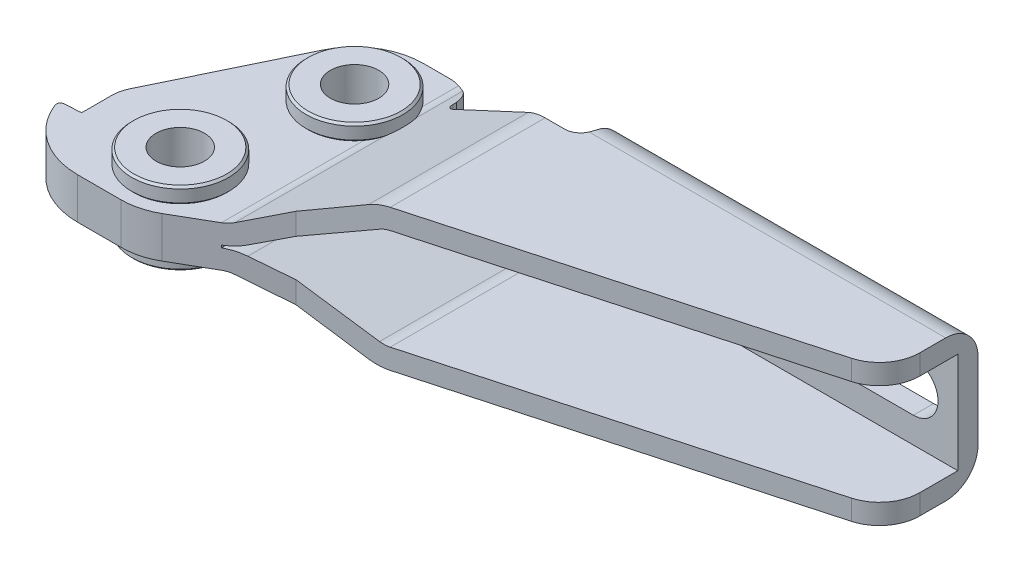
ISO-10303-21;
HEADER;
FILE_DESCRIPTION(('STEP AP214'),'2;1');
FILE_NAME('part.step','',(''),(''),'','','');
FILE_SCHEMA(('AUTOMOTIVE_DESIGN { 1 0 10303 214 1 1 1 1 }'));
ENDSEC;
DATA;
#1=APPLICATION_CONTEXT('core data for automotive mechanical design processes');
#2=APPLICATION_PROTOCOL_DEFINITION('international standard','automotive_design',2000,#1);
#3=PRODUCT_CONTEXT('',#1,'mechanical');
#4=PRODUCT('Part','Part','',(#3));
#5=PRODUCT_RELATED_PRODUCT_CATEGORY('part','',(#4));
#6=PRODUCT_DEFINITION_FORMATION('','',#4);
#7=PRODUCT_DEFINITION_CONTEXT('part definition',#1,'design');
#8=PRODUCT_DEFINITION('design','',#6,#7);
#9=PRODUCT_DEFINITION_SHAPE('','',#8);
#10=(LENGTH_UNIT() NAMED_UNIT(*) SI_UNIT(.MILLI.,.METRE.));
#11=(NAMED_UNIT(*) PLANE_ANGLE_UNIT() SI_UNIT($,.RADIAN.));
#12=(NAMED_UNIT(*) SI_UNIT($,.STERADIAN.) SOLID_ANGLE_UNIT());
#13=UNCERTAINTY_MEASURE_WITH_UNIT(LENGTH_MEASURE(1.E-05),#10,'distance_accuracy_value','');
#14=(GEOMETRIC_REPRESENTATION_CONTEXT(3) GLOBAL_UNCERTAINTY_ASSIGNED_CONTEXT((#13)) GLOBAL_UNIT_ASSIGNED_CONTEXT((#10,
#11,#12)) REPRESENTATION_CONTEXT('',''));
#15=CARTESIAN_POINT('',(0.,0.,0.));
#16=DIRECTION('',(0.,0.,1.));
#17=DIRECTION('',(1.,0.,0.));
#18=AXIS2_PLACEMENT_3D('',#15,#16,#17);
#19=CARTESIAN_POINT('',(4.6,0.15,26.63));
#20=DIRECTION('',(1.,0.,0.));
#21=DIRECTION('',(0.,1.,0.));
#22=AXIS2_PLACEMENT_3D('',#19,#20,#21);
#23=PLANE('',#22);
#24=DIRECTION('',(0.,1.,0.));
#25=VECTOR('',#24,1.);
#26=CARTESIAN_POINT('',(4.6,-20.8134559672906,-3.45));
#27=LINE('',#26,#25);
#28=CARTESIAN_POINT('',(4.6,-0.15,-3.45));
#29=VERTEX_POINT('',#28);
#30=CARTESIAN_POINT('',(4.6,0.15,-3.45));
#31=VERTEX_POINT('',#30);
#32=EDGE_CURVE('E869',#29,#31,#27,.T.);
#33=ORIENTED_EDGE('',*,*,#32,.F.);
#34=DIRECTION('',(0.,0.,-1.));
#35=VECTOR('',#34,1.);
#36=CARTESIAN_POINT('',(4.6,-0.15,26.63));
#37=LINE('',#36,#35);
#38=CARTESIAN_POINT('',(4.6,-0.15,-6.71));
#39=VERTEX_POINT('',#38);
#40=EDGE_CURVE('E416',#29,#39,#37,.T.);
#41=ORIENTED_EDGE('',*,*,#40,.T.);
#42=DIRECTION('',(0.,-1.,0.));
#43=VECTOR('',#42,1.);
#44=CARTESIAN_POINT('',(4.6,0.15,-6.71));
#45=LINE('',#44,#43);
#46=CARTESIAN_POINT('',(4.6,0.15,-6.71));
#47=VERTEX_POINT('',#46);
#48=EDGE_CURVE('E529',#47,#39,#45,.T.);
#49=ORIENTED_EDGE('',*,*,#48,.F.);
#50=DIRECTION('',(0.,0.,-1.));
#51=VECTOR('',#50,1.);
#52=CARTESIAN_POINT('',(4.6,0.15,26.63));
#53=LINE('',#52,#51);
#54=EDGE_CURVE('E415',#31,#47,#53,.T.);
#55=ORIENTED_EDGE('',*,*,#54,.F.);
#56=EDGE_LOOP('',(#33,#41,#49,#55));
#57=FACE_BOUND('',#56,.T.);
#58=ADVANCED_FACE('F14',(#57),#23,.T.);
#59=CARTESIAN_POINT('',(0.,-4.55,0.));
#60=DIRECTION('',(0.,1.,0.));
#61=DIRECTION('',(0.770624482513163,0.,0.637289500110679));
#62=AXIS2_PLACEMENT_3D('',#59,#60,#61);
#63=CYLINDRICAL_SURFACE('',#62,3.);
#64=CARTESIAN_POINT('',(0.,4.55,0.));
#65=DIRECTION('',(0.,1.,0.));
#66=DIRECTION('',(0.770624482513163,0.,0.637289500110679));
#67=AXIS2_PLACEMENT_3D('',#64,#65,#66);
#68=CIRCLE('',#67,3.);
#69=CARTESIAN_POINT('',(2.31187344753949,4.55,1.91186850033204));
#70=VERTEX_POINT('',#69);
#71=EDGE_CURVE('E889',#70,#70,#68,.T.);
#72=ORIENTED_EDGE('',*,*,#71,.T.);
#73=EDGE_LOOP('',(#72));
#74=FACE_BOUND('',#73,.T.);
#75=CARTESIAN_POINT('',(0.,-4.55,0.));
#76=DIRECTION('',(0.,-1.,0.));
#77=DIRECTION('',(0.,0.,1.));
#78=AXIS2_PLACEMENT_3D('',#75,#76,#77);
#79=CIRCLE('',#78,3.);
#80=CARTESIAN_POINT('',(0.,-4.55,3.));
#81=VERTEX_POINT('',#80);
#82=EDGE_CURVE('E790',#81,#81,#79,.F.);
#83=ORIENTED_EDGE('',*,*,#82,.F.);
#84=EDGE_LOOP('',(#83));
#85=FACE_BOUND('',#84,.T.);
#86=ADVANCED_FACE('F722',(#74,#85),#63,.F.);
#87=CARTESIAN_POINT('',(0.,-2.55,0.));
#88=DIRECTION('',(0.,-1.,0.));
#89=DIRECTION('',(-0.770624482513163,0.,-0.637289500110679));
#90=AXIS2_PLACEMENT_3D('',#87,#88,#89);
#91=CYLINDRICAL_SURFACE('',#90,6.);
#92=CARTESIAN_POINT('',(0.,-4.3,0.));
#93=DIRECTION('',(0.,-1.,0.));
#94=DIRECTION('',(0.,0.,1.));
#95=AXIS2_PLACEMENT_3D('',#92,#93,#94);
#96=CIRCLE('',#95,6.);
#97=CARTESIAN_POINT('',(0.,-4.3,6.00000000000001));
#98=VERTEX_POINT('',#97);
#99=EDGE_CURVE('E794',#98,#98,#96,.F.);
#100=ORIENTED_EDGE('',*,*,#99,.T.);
#101=EDGE_LOOP('',(#100));
#102=FACE_BOUND('',#101,.T.);
#103=CARTESIAN_POINT('',(5.6535108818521,-2.7828178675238,-2.0094314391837));
#104=CARTESIAN_POINT('',(5.64179662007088,-2.77736519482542,-2.04238909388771));
#105=CARTESIAN_POINT('',(5.6297965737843,-2.77190403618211,-2.0752380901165));
#106=CARTESIAN_POINT('',(5.60522491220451,-2.76096474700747,-2.14071876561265));
#107=CARTESIAN_POINT('',(5.5926532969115,-2.75548661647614,-2.17335044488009));
#108=CARTESIAN_POINT('',(5.57979589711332,-2.74999999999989,-2.20587346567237));
#109=B_SPLINE_CURVE_WITH_KNOTS('',3,(#103,#104,#105,#106,#107,#108),.UNSPECIFIED.,.F.,.F.,(4,2,
4),(0.,0.106188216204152,0.212376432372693),.UNSPECIFIED.);
#110=CARTESIAN_POINT('',(5.6535108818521,-2.7828178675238,-2.0094314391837));
#111=VERTEX_POINT('',#110);
#112=CARTESIAN_POINT('',(5.57979589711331,-2.75,-2.20587346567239));
#113=VERTEX_POINT('',#112);
#114=EDGE_CURVE('E749',#111,#113,#109,.T.);
#115=ORIENTED_EDGE('',*,*,#114,.F.);
#116=CARTESIAN_POINT('',(0.,-0.155752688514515,0.));
#117=DIRECTION('',(-0.421404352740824,-0.906872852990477,0.));
#118=DIRECTION('',(0.906872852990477,-0.421404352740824,0.));
#119=AXIS2_PLACEMENT_3D('',#116,#117,#118);
#120=ELLIPSE('',#119,6.61614247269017,6.);
#121=CARTESIAN_POINT('',(5.6535108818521,-2.7828178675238,2.00943143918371));
#122=VERTEX_POINT('',#121);
#123=EDGE_CURVE('E783',#122,#111,#120,.F.);
#124=ORIENTED_EDGE('',*,*,#123,.F.);
#125=CARTESIAN_POINT('',(5.57979589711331,-2.75,2.2058734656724));
#126=CARTESIAN_POINT('',(5.5926532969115,-2.75548661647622,2.17335044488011));
#127=CARTESIAN_POINT('',(5.60522491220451,-2.76096474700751,2.14071876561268));
#128=CARTESIAN_POINT('',(5.6297965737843,-2.77190403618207,2.07523809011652));
#129=CARTESIAN_POINT('',(5.64179662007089,-2.77736519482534,2.04238909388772));
#130=CARTESIAN_POINT('',(5.65351088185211,-2.78281786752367,2.0094314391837));
#131=B_SPLINE_CURVE_WITH_KNOTS('',3,(#125,#126,#127,#128,#129,#130),.UNSPECIFIED.,.F.,.F.,(4,2,
4),(0.,0.10618821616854,0.21237643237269),.UNSPECIFIED.);
#132=CARTESIAN_POINT('',(5.57979589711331,-2.75,2.2058734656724));
#133=VERTEX_POINT('',#132);
#134=EDGE_CURVE('E742',#133,#122,#131,.T.);
#135=ORIENTED_EDGE('',*,*,#134,.F.);
#136=CARTESIAN_POINT('',(0.,-2.75,0.));
#137=DIRECTION('',(0.,-1.,0.));
#138=DIRECTION('',(-0.770624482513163,0.,-0.637289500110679));
#139=AXIS2_PLACEMENT_3D('',#136,#137,#138);
#140=CIRCLE('',#139,6.);
#141=EDGE_CURVE('E1091',#133,#113,#140,.T.);
#142=ORIENTED_EDGE('',*,*,#141,.T.);
#143=EDGE_LOOP('',(#115,#124,#135,#142));
#144=FACE_BOUND('',#143,.T.);
#145=ADVANCED_FACE('F726',(#102,#144),#91,.T.);
#146=CARTESIAN_POINT('',(-4.05,-2.55,17.54));
#147=DIRECTION('',(0.,-1.,0.));
#148=DIRECTION('',(-0.770624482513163,0.,-0.637289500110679));
#149=AXIS2_PLACEMENT_3D('',#146,#147,#148);
#150=CYLINDRICAL_SURFACE('',#149,6.);
#151=CARTESIAN_POINT('',(-4.05,-4.3,17.54));
#152=DIRECTION('',(0.,-1.,0.));
#153=DIRECTION('',(1.,0.,0.));
#154=AXIS2_PLACEMENT_3D('',#151,#152,#153);
#155=CIRCLE('',#154,6.);
#156=CARTESIAN_POINT('',(1.95,-4.3,17.54));
#157=VERTEX_POINT('',#156);
#158=EDGE_CURVE('E9',#157,#157,#155,.F.);
#159=ORIENTED_EDGE('',*,*,#158,.T.);
#160=EDGE_LOOP('',(#159));
#161=FACE_BOUND('',#160,.T.);
#162=CARTESIAN_POINT('',(-4.05,-2.75,17.54));
#163=DIRECTION('',(0.,-1.,0.));
#164=DIRECTION('',(-0.770624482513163,0.,-0.637289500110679));
#165=AXIS2_PLACEMENT_3D('',#162,#163,#164);
#166=CIRCLE('',#165,6.);
#167=CARTESIAN_POINT('',(-8.67374689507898,-2.75,13.7162629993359));
#168=VERTEX_POINT('',#167);
#169=EDGE_CURVE('E1095',#168,#168,#166,.T.);
#170=ORIENTED_EDGE('',*,*,#169,.T.);
#171=EDGE_LOOP('',(#170));
#172=FACE_BOUND('',#171,.T.);
#173=ADVANCED_FACE('F736',(#161,#172),#150,.T.);
#174=CARTESIAN_POINT('',(-4.05,-4.55,17.54));
#175=DIRECTION('',(0.,1.,0.));
#176=DIRECTION('',(0.770624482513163,0.,0.637289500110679));
#177=AXIS2_PLACEMENT_3D('',#174,#175,#176);
#178=CYLINDRICAL_SURFACE('',#177,3.);
#179=CARTESIAN_POINT('',(-4.05,4.55,17.54));
#180=DIRECTION('',(0.,1.,0.));
#181=DIRECTION('',(0.770624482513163,0.,0.637289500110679));
#182=AXIS2_PLACEMENT_3D('',#179,#180,#181);
#183=CIRCLE('',#182,3.);
#184=CARTESIAN_POINT('',(-1.73812655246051,4.55,19.451868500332));
#185=VERTEX_POINT('',#184);
#186=EDGE_CURVE('E707',#185,#185,#183,.T.);
#187=ORIENTED_EDGE('',*,*,#186,.T.);
#188=EDGE_LOOP('',(#187));
#189=FACE_BOUND('',#188,.T.);
#190=CARTESIAN_POINT('',(-4.05,-4.55,17.54));
#191=DIRECTION('',(0.,-1.,0.));
#192=DIRECTION('',(0.,0.,1.));
#193=AXIS2_PLACEMENT_3D('',#190,#191,#192);
#194=CIRCLE('',#193,3.);
#195=CARTESIAN_POINT('',(-4.05,-4.55,20.54));
#196=VERTEX_POINT('',#195);
#197=EDGE_CURVE('E786',#196,#196,#194,.F.);
#198=ORIENTED_EDGE('',*,*,#197,.F.);
#199=EDGE_LOOP('',(#198));
#200=FACE_BOUND('',#199,.T.);
#201=ADVANCED_FACE('F1116',(#189,#200),#178,.F.);
#202=CARTESIAN_POINT('',(0.,-4.55,0.));
#203=DIRECTION('',(0.,1.,0.));
#204=DIRECTION('',(0.770624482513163,0.,0.637289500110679));
#205=AXIS2_PLACEMENT_3D('',#202,#203,#204);
#206=CYLINDRICAL_SURFACE('',#205,6.);
#207=CARTESIAN_POINT('',(0.,0.155752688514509,0.));
#208=DIRECTION('',(-0.421404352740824,0.906872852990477,0.));
#209=DIRECTION('',(0.906872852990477,0.421404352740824,0.));
#210=AXIS2_PLACEMENT_3D('',#207,#208,#209);
#211=ELLIPSE('',#210,6.61614247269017,6.);
#212=CARTESIAN_POINT('',(5.69048726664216,2.8,-1.90219732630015));
#213=VERTEX_POINT('',#212);
#214=CARTESIAN_POINT('',(5.69048726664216,2.8,1.90219732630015));
#215=VERTEX_POINT('',#214);
#216=EDGE_CURVE('E1069',#213,#215,#211,.F.);
#217=ORIENTED_EDGE('',*,*,#216,.F.);
#218=CARTESIAN_POINT('',(0.,2.8,0.));
#219=DIRECTION('',(0.,1.,0.));
#220=DIRECTION('',(0.770624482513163,0.,0.637289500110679));
#221=AXIS2_PLACEMENT_3D('',#218,#219,#220);
#222=CIRCLE('',#221,6.);
#223=EDGE_CURVE('E1452',#213,#215,#222,.T.);
#224=ORIENTED_EDGE('',*,*,#223,.T.);
#225=EDGE_LOOP('',(#217,#224));
#226=FACE_BOUND('',#225,.T.);
#227=CARTESIAN_POINT('',(0.,4.3,0.));
#228=DIRECTION('',(0.,1.,0.));
#229=DIRECTION('',(0.770624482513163,0.,0.637289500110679));
#230=AXIS2_PLACEMENT_3D('',#227,#228,#229);
#231=CIRCLE('',#230,6.);
#232=CARTESIAN_POINT('',(4.62374689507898,4.3,3.82373700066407));
#233=VERTEX_POINT('',#232);
#234=EDGE_CURVE('E1098',#233,#233,#231,.T.);
#235=ORIENTED_EDGE('',*,*,#234,.F.);
#236=EDGE_LOOP('',(#235));
#237=FACE_BOUND('',#236,.T.);
#238=ADVANCED_FACE('F471',(#226,#237),#206,.T.);
#239=CARTESIAN_POINT('',(0.,2.55,0.));
#240=DIRECTION('',(0.,1.,0.));
#241=DIRECTION('',(0.770624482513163,0.,0.637289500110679));
#242=AXIS2_PLACEMENT_3D('',#239,#240,#241);
#243=CONICAL_SURFACE('',#242,5.75,0.785398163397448);
#244=CARTESIAN_POINT('',(5.74029161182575,2.8252,1.8308706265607));
#245=CARTESIAN_POINT('',(5.69062976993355,2.79978605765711,1.902985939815));
#246=CARTESIAN_POINT('',(5.64102169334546,2.7764202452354,1.97582976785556));
#247=CARTESIAN_POINT('',(5.54150013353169,2.73341557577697,2.12238873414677));
#248=CARTESIAN_POINT('',(5.49158670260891,2.7137760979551,2.19610372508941));
#249=CARTESIAN_POINT('',(5.39131483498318,2.67795004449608,2.34341823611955));
#250=CARTESIAN_POINT('',(5.34096061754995,2.66174423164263,2.41701597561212));
#251=CARTESIAN_POINT('',(5.23939214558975,2.63256890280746,2.56425846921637));
#252=CARTESIAN_POINT('',(5.18817783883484,2.61959958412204,2.63790322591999));
#253=CARTESIAN_POINT('',(5.0331388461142,2.58553446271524,2.85861551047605));
#254=CARTESIAN_POINT('',(4.92790048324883,2.56927519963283,3.00548715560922));
#255=CARTESIAN_POINT('',(4.76734456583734,2.55502522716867,3.22506243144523));
#256=CARTESIAN_POINT('',(4.71321385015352,2.55197112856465,3.29834545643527));
#257=CARTESIAN_POINT('',(4.60428961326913,2.54940976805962,3.44449457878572));
#258=CARTESIAN_POINT('',(4.54949600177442,2.54990299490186,3.51736061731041));
#259=CARTESIAN_POINT('',(4.49444891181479,2.5522292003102,3.58999578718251));
#260=B_SPLINE_CURVE_WITH_KNOTS('',3,(#244,#245,#246,#247,#248,#249,#250,#251,#252,#253,#254,
#255,#256,#257,#258,#259),.UNSPECIFIED.,.F.,.F.,(4,2,2,2,2,2,2,4),(0.,0.273462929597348,
0.546880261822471,0.818722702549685,1.09058171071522,1.63420362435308,1.90761902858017,
2.18107210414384),.UNSPECIFIED.);
#261=CARTESIAN_POINT('',(5.6535108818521,2.7828178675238,1.95753016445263));
#262=VERTEX_POINT('',#261);
#263=CARTESIAN_POINT('',(4.6,2.55,3.45));
#264=VERTEX_POINT('',#263);
#265=EDGE_CURVE('E705',#262,#264,#260,.T.);
#266=ORIENTED_EDGE('',*,*,#265,.F.);
#267=CARTESIAN_POINT('',(1.98877471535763,1.07989361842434,0.));
#268=DIRECTION('',(-0.421404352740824,0.906872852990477,0.));
#269=DIRECTION('',(0.906872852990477,0.421404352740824,0.));
#270=AXIS2_PLACEMENT_3D('',#267,#268,#269);
#271=ELLIPSE('',#270,4.71939765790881,3.78975784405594);
#272=EDGE_CURVE('E706',#215,#262,#271,.F.);
#273=ORIENTED_EDGE('',*,*,#272,.F.);
#274=ORIENTED_EDGE('',*,*,#223,.F.);
#275=CARTESIAN_POINT('',(5.6535108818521,2.7828178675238,-1.95753016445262));
#276=VERTEX_POINT('',#275);
#277=EDGE_CURVE('E1071',#276,#213,#271,.F.);
#278=ORIENTED_EDGE('',*,*,#277,.F.);
#279=CARTESIAN_POINT('',(4.49444891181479,2.5522292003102,-3.58999578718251));
#280=CARTESIAN_POINT('',(4.54949600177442,2.54990299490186,-3.51736061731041));
#281=CARTESIAN_POINT('',(4.60428961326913,2.54940976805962,-3.44449457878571));
#282=CARTESIAN_POINT('',(4.71321385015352,2.55197112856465,-3.29834545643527));
#283=CARTESIAN_POINT('',(4.76734456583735,2.55502522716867,-3.22506243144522));
#284=CARTESIAN_POINT('',(4.92790048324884,2.56927519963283,-3.00548715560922));
#285=CARTESIAN_POINT('',(5.0331388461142,2.58553446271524,-2.85861551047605));
#286=CARTESIAN_POINT('',(5.18817783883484,2.61959958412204,-2.63790322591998));
#287=CARTESIAN_POINT('',(5.23939214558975,2.63256890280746,-2.56425846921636));
#288=CARTESIAN_POINT('',(5.34096061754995,2.66174423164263,-2.41701597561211));
#289=CARTESIAN_POINT('',(5.39131483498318,2.67795004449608,-2.34341823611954));
#290=CARTESIAN_POINT('',(5.49158670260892,2.7137760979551,-2.19610372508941));
#291=CARTESIAN_POINT('',(5.54150013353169,2.73341557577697,-2.12238873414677));
#292=CARTESIAN_POINT('',(5.64102169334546,2.7764202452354,-1.97582976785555));
#293=CARTESIAN_POINT('',(5.69062976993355,2.79978605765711,-1.902985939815));
#294=CARTESIAN_POINT('',(5.74029161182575,2.8252,-1.8308706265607));
#295=B_SPLINE_CURVE_WITH_KNOTS('',3,(#279,#280,#281,#282,#283,#284,#285,#286,#287,#288,#289,
#290,#291,#292,#293,#294),.UNSPECIFIED.,.F.,.F.,(4,2,2,2,2,2,2,4),(0.,0.273453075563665,
0.54686847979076,1.09049039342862,1.36234940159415,1.63419184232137,1.90760917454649,
2.18107210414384),.UNSPECIFIED.);
#296=CARTESIAN_POINT('',(4.6,2.55,-3.45));
#297=VERTEX_POINT('',#296);
#298=EDGE_CURVE('E697',#297,#276,#295,.T.);
#299=ORIENTED_EDGE('',*,*,#298,.F.);
#300=CARTESIAN_POINT('',(0.,2.55,0.));
#301=DIRECTION('',(0.,1.,0.));
#302=DIRECTION('',(0.,0.,-1.));
#303=AXIS2_PLACEMENT_3D('',#300,#301,#302);
#304=CIRCLE('',#303,5.75);
#305=EDGE_CURVE('E795',#264,#297,#304,.F.);
#306=ORIENTED_EDGE('',*,*,#305,.F.);
#307=EDGE_LOOP('',(#266,#273,#274,#278,#299,#306));
#308=FACE_BOUND('',#307,.T.);
#309=ADVANCED_FACE('F714',(#308),#243,.T.);
#310=CARTESIAN_POINT('',(0.,4.3,0.));
#311=DIRECTION('',(0.,-1.,0.));
#312=DIRECTION('',(-0.770624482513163,0.,-0.637289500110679));
#313=AXIS2_PLACEMENT_3D('',#310,#311,#312);
#314=CONICAL_SURFACE('',#313,6.,0.785398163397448);
#315=CARTESIAN_POINT('',(0.,4.55,0.));
#316=DIRECTION('',(0.,1.,0.));
#317=DIRECTION('',(0.770624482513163,0.,0.637289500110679));
#318=AXIS2_PLACEMENT_3D('',#315,#316,#317);
#319=CIRCLE('',#318,5.75);
#320=CARTESIAN_POINT('',(4.43109077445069,4.55,3.6644146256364));
#321=VERTEX_POINT('',#320);
#322=EDGE_CURVE('E1094',#321,#321,#319,.T.);
#323=ORIENTED_EDGE('',*,*,#322,.F.);
#324=EDGE_LOOP('',(#323));
#325=FACE_BOUND('',#324,.T.);
#326=ORIENTED_EDGE('',*,*,#234,.T.);
#327=EDGE_LOOP('',(#326));
#328=FACE_BOUND('',#327,.T.);
#329=ADVANCED_FACE('F719',(#325,#328),#314,.T.);
#330=CARTESIAN_POINT('',(3.66441462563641,4.55,-4.43109077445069));
#331=DIRECTION('',(0.,-1.,0.));
#332=DIRECTION('',(-0.770624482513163,0.,-0.637289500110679));
#333=AXIS2_PLACEMENT_3D('',#330,#331,#332);
#334=PLANE('',#333);
#335=ORIENTED_EDGE('',*,*,#71,.F.);
#336=EDGE_LOOP('',(#335));
#337=FACE_BOUND('',#336,.T.);
#338=ORIENTED_EDGE('',*,*,#322,.T.);
#339=EDGE_LOOP('',(#338));
#340=FACE_BOUND('',#339,.T.);
#341=ADVANCED_FACE('F728',(#337,#340),#334,.F.);
#342=CARTESIAN_POINT('',(-4.05,-2.55,17.54));
#343=DIRECTION('',(0.,-1.,0.));
#344=DIRECTION('',(-0.770624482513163,0.,-0.637289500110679));
#345=AXIS2_PLACEMENT_3D('',#342,#343,#344);
#346=CONICAL_SURFACE('',#345,5.8,0.785398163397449);
#347=ORIENTED_EDGE('',*,*,#169,.F.);
#348=EDGE_LOOP('',(#347));
#349=FACE_BOUND('',#348,.T.);
#350=CARTESIAN_POINT('',(-4.05,-2.55,17.54));
#351=DIRECTION('',(0.,-1.,0.));
#352=DIRECTION('',(0.,0.,1.));
#353=AXIS2_PLACEMENT_3D('',#350,#351,#352);
#354=CIRCLE('',#353,5.8);
#355=CARTESIAN_POINT('',(-4.05,-2.55,23.34));
#356=VERTEX_POINT('',#355);
#357=EDGE_CURVE('E1074',#356,#356,#354,.F.);
#358=ORIENTED_EDGE('',*,*,#357,.F.);
#359=EDGE_LOOP('',(#358));
#360=FACE_BOUND('',#359,.T.);
#361=ADVANCED_FACE('F458',(#349,#360),#346,.T.);
#362=CARTESIAN_POINT('',(-4.05,2.55,17.54));
#363=DIRECTION('',(0.,1.,0.));
#364=DIRECTION('',(0.770624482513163,0.,0.637289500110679));
#365=AXIS2_PLACEMENT_3D('',#362,#363,#364);
#366=CONICAL_SURFACE('',#365,5.75,0.785398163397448);
#367=CARTESIAN_POINT('',(-4.05,2.8,17.54));
#368=DIRECTION('',(0.,1.,0.));
#369=DIRECTION('',(0.770624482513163,0.,0.637289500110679));
#370=AXIS2_PLACEMENT_3D('',#367,#368,#369);
#371=CIRCLE('',#370,6.);
#372=CARTESIAN_POINT('',(0.573746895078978,2.8,21.3637370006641));
#373=VERTEX_POINT('',#372);
#374=EDGE_CURVE('E1109',#373,#373,#371,.T.);
#375=ORIENTED_EDGE('',*,*,#374,.F.);
#376=EDGE_LOOP('',(#375));
#377=FACE_BOUND('',#376,.T.);
#378=CARTESIAN_POINT('',(-4.05,2.55,17.54));
#379=DIRECTION('',(0.,1.,0.));
#380=DIRECTION('',(0.,0.,-1.));
#381=AXIS2_PLACEMENT_3D('',#378,#379,#380);
#382=CIRCLE('',#381,5.75);
#383=CARTESIAN_POINT('',(-4.05,2.55,11.79));
#384=VERTEX_POINT('',#383);
#385=EDGE_CURVE('E757',#384,#384,#382,.F.);
#386=ORIENTED_EDGE('',*,*,#385,.F.);
#387=EDGE_LOOP('',(#386));
#388=FACE_BOUND('',#387,.T.);
#389=ADVANCED_FACE('F1124',(#377,#388),#366,.T.);
#390=CARTESIAN_POINT('',(-4.05,-4.55,17.54));
#391=DIRECTION('',(0.,1.,0.));
#392=DIRECTION('',(0.770624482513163,0.,0.637289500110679));
#393=AXIS2_PLACEMENT_3D('',#390,#391,#392);
#394=CYLINDRICAL_SURFACE('',#393,6.);
#395=CARTESIAN_POINT('',(-4.05,4.3,17.54));
#396=DIRECTION('',(0.,1.,0.));
#397=DIRECTION('',(0.770624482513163,0.,0.637289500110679));
#398=AXIS2_PLACEMENT_3D('',#395,#396,#397);
#399=CIRCLE('',#398,6.);
#400=CARTESIAN_POINT('',(0.573746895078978,4.3,21.3637370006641));
#401=VERTEX_POINT('',#400);
#402=EDGE_CURVE('E1107',#401,#401,#399,.T.);
#403=ORIENTED_EDGE('',*,*,#402,.F.);
#404=EDGE_LOOP('',(#403));
#405=FACE_BOUND('',#404,.T.);
#406=ORIENTED_EDGE('',*,*,#374,.T.);
#407=EDGE_LOOP('',(#406));
#408=FACE_BOUND('',#407,.T.);
#409=ADVANCED_FACE('F1129',(#405,#408),#394,.T.);
#410=CARTESIAN_POINT('',(-4.05,4.3,17.54));
#411=DIRECTION('',(0.,-1.,0.));
#412=DIRECTION('',(-0.770624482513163,0.,-0.637289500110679));
#413=AXIS2_PLACEMENT_3D('',#410,#411,#412);
#414=CONICAL_SURFACE('',#413,6.,0.785398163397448);
#415=CARTESIAN_POINT('',(-4.05,4.55,17.54));
#416=DIRECTION('',(0.,1.,0.));
#417=DIRECTION('',(0.770624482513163,0.,0.637289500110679));
#418=AXIS2_PLACEMENT_3D('',#415,#416,#417);
#419=CIRCLE('',#418,5.75);
#420=CARTESIAN_POINT('',(0.381090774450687,4.55,21.2044146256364));
#421=VERTEX_POINT('',#420);
#422=EDGE_CURVE('E789',#421,#421,#419,.T.);
#423=ORIENTED_EDGE('',*,*,#422,.F.);
#424=EDGE_LOOP('',(#423));
#425=FACE_BOUND('',#424,.T.);
#426=ORIENTED_EDGE('',*,*,#402,.T.);
#427=EDGE_LOOP('',(#426));
#428=FACE_BOUND('',#427,.T.);
#429=ADVANCED_FACE('F1122',(#425,#428),#414,.T.);
#430=CARTESIAN_POINT('',(-0.385585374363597,4.55,13.1089092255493));
#431=DIRECTION('',(0.,-1.,0.));
#432=DIRECTION('',(-0.770624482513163,0.,-0.637289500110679));
#433=AXIS2_PLACEMENT_3D('',#430,#431,#432);
#434=PLANE('',#433);
#435=ORIENTED_EDGE('',*,*,#186,.F.);
#436=EDGE_LOOP('',(#435));
#437=FACE_BOUND('',#436,.T.);
#438=ORIENTED_EDGE('',*,*,#422,.T.);
#439=EDGE_LOOP('',(#438));
#440=FACE_BOUND('',#439,.T.);
#441=ADVANCED_FACE('F1119',(#437,#440),#434,.F.);
#442=CARTESIAN_POINT('',(0.,-2.55,0.));
#443=DIRECTION('',(0.,-1.,0.));
#444=DIRECTION('',(-0.770624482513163,0.,-0.637289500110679));
#445=AXIS2_PLACEMENT_3D('',#442,#443,#444);
#446=CONICAL_SURFACE('',#445,5.8,0.785398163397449);
#447=CARTESIAN_POINT('',(5.62592005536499,-2.7702,-2.14285593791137));
#448=CARTESIAN_POINT('',(5.58008392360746,-2.74959539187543,-2.2053320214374));
#449=CARTESIAN_POINT('',(5.53428340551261,-2.73062552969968,-2.26835489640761));
#450=CARTESIAN_POINT('',(5.44251087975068,-2.69572471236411,-2.39510061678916));
#451=CARTESIAN_POINT('',(5.39653889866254,-2.67979330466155,-2.45882335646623));
#452=CARTESIAN_POINT('',(5.30439437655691,-2.65080427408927,-2.58627983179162));
#453=CARTESIAN_POINT('',(5.2582239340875,-2.63773290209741,-2.65001197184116));
#454=CARTESIAN_POINT('',(5.16536687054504,-2.61429581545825,-2.77759649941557));
#455=CARTESIAN_POINT('',(5.11868022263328,-2.60393024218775,-2.84144889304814));
#456=CARTESIAN_POINT('',(4.97777456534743,-2.5768565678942,-3.03294805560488));
#457=CARTESIAN_POINT('',(4.88269090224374,-2.56416556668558,-3.16056321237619));
#458=CARTESIAN_POINT('',(4.73836648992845,-2.55336359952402,-3.35161589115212));
#459=CARTESIAN_POINT('',(4.68984998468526,-2.55114027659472,-3.41539972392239));
#460=CARTESIAN_POINT('',(4.59242234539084,-2.54953664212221,-3.5426981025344));
#461=CARTESIAN_POINT('',(4.54351122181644,-2.55015625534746,-3.60621265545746));
#462=CARTESIAN_POINT('',(4.49444891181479,-2.5522292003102,-3.66957663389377));
#463=B_SPLINE_CURVE_WITH_KNOTS('',3,(#447,#448,#449,#450,#451,#452,#453,#454,#455,#456,#457,
#458,#459,#460,#461,#462),.UNSPECIFIED.,.F.,.F.,(4,2,2,2,2,2,2,4),(0.,0.240499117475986,
0.480962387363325,0.72024295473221,0.959536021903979,1.43802324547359,1.67848964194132,
1.91894967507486),.UNSPECIFIED.);
#464=CARTESIAN_POINT('',(4.6,-2.55,-3.53270434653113));
#465=VERTEX_POINT('',#464);
#466=EDGE_CURVE('E755',#113,#465,#463,.T.);
#467=ORIENTED_EDGE('',*,*,#466,.F.);
#468=ORIENTED_EDGE('',*,*,#141,.F.);
#469=CARTESIAN_POINT('',(4.49444891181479,-2.5522292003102,3.66957663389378));
#470=CARTESIAN_POINT('',(4.54351122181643,-2.55015625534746,3.60621265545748));
#471=CARTESIAN_POINT('',(4.59242234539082,-2.54953664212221,3.54269810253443));
#472=CARTESIAN_POINT('',(4.68984998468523,-2.55114027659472,3.41539972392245));
#473=CARTESIAN_POINT('',(4.73836648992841,-2.55336359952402,3.35161589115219));
#474=CARTESIAN_POINT('',(4.88269090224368,-2.56416556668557,3.16056321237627));
#475=CARTESIAN_POINT('',(4.97777456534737,-2.57685656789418,3.03294805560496));
#476=CARTESIAN_POINT('',(5.11868022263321,-2.60393024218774,2.84144889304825));
#477=CARTESIAN_POINT('',(5.16536687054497,-2.61429581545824,2.7775964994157));
#478=CARTESIAN_POINT('',(5.2582239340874,-2.63773290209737,2.65001197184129));
#479=CARTESIAN_POINT('',(5.30439437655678,-2.65080427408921,2.58627983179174));
#480=CARTESIAN_POINT('',(5.39653889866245,-2.67979330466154,2.45882335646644));
#481=CARTESIAN_POINT('',(5.44251087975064,-2.69572471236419,2.39510061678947));
#482=CARTESIAN_POINT('',(5.53428340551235,-2.73062552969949,2.26835489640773));
#483=CARTESIAN_POINT('',(5.58008392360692,-2.74959539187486,2.20533202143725));
#484=CARTESIAN_POINT('',(5.62592005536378,-2.77019999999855,2.14285593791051));
#485=B_SPLINE_CURVE_WITH_KNOTS('',3,(#469,#470,#471,#472,#473,#474,#475,#476,#477,#478,#479,
#480,#481,#482,#483,#484),.UNSPECIFIED.,.F.,.F.,(4,2,2,2,2,2,2,4),(0.,0.240460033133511,
0.4809264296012,0.959413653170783,1.19870672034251,1.43798728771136,1.67845055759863,
1.91894967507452),.UNSPECIFIED.);
#486=CARTESIAN_POINT('',(4.6,-2.55,3.53270434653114));
#487=VERTEX_POINT('',#486);
#488=EDGE_CURVE('E756',#487,#133,#485,.T.);
#489=ORIENTED_EDGE('',*,*,#488,.F.);
#490=CARTESIAN_POINT('',(0.,-2.55,0.));
#491=DIRECTION('',(0.,-1.,0.));
#492=DIRECTION('',(0.,0.,1.));
#493=AXIS2_PLACEMENT_3D('',#490,#491,#492);
#494=CIRCLE('',#493,5.8);
#495=EDGE_CURVE('E1076',#465,#487,#494,.F.);
#496=ORIENTED_EDGE('',*,*,#495,.F.);
#497=EDGE_LOOP('',(#467,#468,#489,#496));
#498=FACE_BOUND('',#497,.T.);
#499=ADVANCED_FACE('F732',(#498),#446,.T.);
#500=CARTESIAN_POINT('',(4.6,-2.55,26.84));
#501=DIRECTION('',(0.,-1.,0.));
#502=DIRECTION('',(0.,0.,1.));
#503=AXIS2_PLACEMENT_3D('',#500,#501,#502);
#504=PLANE('',#503);
#505=ORIENTED_EDGE('',*,*,#357,.T.);
#506=EDGE_LOOP('',(#505));
#507=FACE_BOUND('',#506,.T.);
#508=DIRECTION('',(0.,0.,-1.));
#509=VECTOR('',#508,1.);
#510=CARTESIAN_POINT('',(4.6,-2.55,26.84));
#511=LINE('',#510,#509);
#512=CARTESIAN_POINT('',(4.6,-2.55,-8.28627785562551));
#513=VERTEX_POINT('',#512);
#514=EDGE_CURVE('E1162',#465,#513,#511,.T.);
#515=ORIENTED_EDGE('',*,*,#514,.F.);
#516=ORIENTED_EDGE('',*,*,#495,.T.);
#517=CARTESIAN_POINT('',(4.6,-2.55,21.0935244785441));
#518=VERTEX_POINT('',#517);
#519=EDGE_CURVE('E1086',#518,#487,#511,.T.);
#520=ORIENTED_EDGE('',*,*,#519,.F.);
#521=DIRECTION('',(0.866025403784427,0.,-0.50000000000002));
#522=VECTOR('',#521,1.);
#523=CARTESIAN_POINT('',(-0.0499999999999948,-2.55,23.778203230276));
#524=LINE('',#523,#522);
#525=CARTESIAN_POINT('',(-0.0499999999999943,-2.55,23.778203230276));
#526=VERTEX_POINT('',#525);
#527=EDGE_CURVE('E1027',#526,#518,#524,.T.);
#528=ORIENTED_EDGE('',*,*,#527,.F.);
#529=CARTESIAN_POINT('',(-4.04999999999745,-2.55,16.8500000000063));
#530=DIRECTION('',(0.,-1.,0.));
#531=DIRECTION('',(0.,0.,1.));
#532=AXIS2_PLACEMENT_3D('',#529,#530,#531);
#533=CIRCLE('',#532,7.99999999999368);
#534=CARTESIAN_POINT('',(-4.04999999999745,-2.55,24.85));
#535=VERTEX_POINT('',#534);
#536=EDGE_CURVE('E1203',#535,#526,#533,.F.);
#537=ORIENTED_EDGE('',*,*,#536,.F.);
#538=DIRECTION('',(1.,0.,0.));
#539=VECTOR('',#538,1.);
#540=CARTESIAN_POINT('',(-9.45,-2.55,24.85));
#541=LINE('',#540,#539);
#542=CARTESIAN_POINT('',(-9.45,-2.55,24.85));
#543=VERTEX_POINT('',#542);
#544=EDGE_CURVE('E1206',#543,#535,#541,.T.);
#545=ORIENTED_EDGE('',*,*,#544,.F.);
#546=CARTESIAN_POINT('',(-9.45000000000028,-2.55,15.3400000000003));
#547=DIRECTION('',(0.,-1.,0.));
#548=DIRECTION('',(0.,0.,1.));
#549=AXIS2_PLACEMENT_3D('',#546,#547,#548);
#550=CIRCLE('',#549,9.50999999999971);
#551=CARTESIAN_POINT('',(-18.324877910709,-2.55,18.75711019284));
#552=VERTEX_POINT('',#551);
#553=EDGE_CURVE('E1209',#552,#543,#550,.F.);
#554=ORIENTED_EDGE('',*,*,#553,.F.);
#555=CARTESIAN_POINT('',(-17.8582702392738,-2.55,18.5774514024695));
#556=DIRECTION('',(0.,-1.,0.));
#557=DIRECTION('',(0.,0.,1.));
#558=AXIS2_PLACEMENT_3D('',#555,#556,#557);
#559=CIRCLE('',#558,0.499999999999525);
#560=CARTESIAN_POINT('',(-17.887253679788,-2.55,18.078292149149));
#561=VERTEX_POINT('',#560);
#562=EDGE_CURVE('E1212',#561,#552,#559,.F.);
#563=ORIENTED_EDGE('',*,*,#562,.F.);
#564=DIRECTION('',(-0.998318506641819,0.,0.0579668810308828));
#565=VECTOR('',#564,1.);
#566=CARTESIAN_POINT('',(-16.038406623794,-2.55,17.970939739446));
#567=LINE('',#566,#565);
#568=CARTESIAN_POINT('',(-16.038406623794,-2.55,17.970939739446));
#569=VERTEX_POINT('',#568);
#570=EDGE_CURVE('E1215',#569,#561,#567,.T.);
#571=ORIENTED_EDGE('',*,*,#570,.F.);
#572=CARTESIAN_POINT('',(-16.05,-2.55,17.7712760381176));
#573=DIRECTION('',(0.,-1.,0.));
#574=DIRECTION('',(0.,0.,1.));
#575=AXIS2_PLACEMENT_3D('',#572,#573,#574);
#576=CIRCLE('',#575,0.200000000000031);
#577=CARTESIAN_POINT('',(-15.85,-2.55,17.771276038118));
#578=VERTEX_POINT('',#577);
#579=EDGE_CURVE('E1218',#578,#569,#576,.T.);
#580=ORIENTED_EDGE('',*,*,#579,.F.);
#581=DIRECTION('',(0.,0.,1.));
#582=VECTOR('',#581,1.);
#583=CARTESIAN_POINT('',(-15.85,-2.55,14.180755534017));
#584=LINE('',#583,#582);
#585=CARTESIAN_POINT('',(-15.85,-2.55,14.180755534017));
#586=VERTEX_POINT('',#585);
#587=EDGE_CURVE('E1221',#586,#578,#584,.T.);
#588=ORIENTED_EDGE('',*,*,#587,.F.);
#589=CARTESIAN_POINT('',(-11.850000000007,-2.55,14.1807555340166));
#590=DIRECTION('',(0.,-1.,0.));
#591=DIRECTION('',(0.,0.,1.));
#592=AXIS2_PLACEMENT_3D('',#589,#590,#591);
#593=CIRCLE('',#592,3.99999999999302);
#594=CARTESIAN_POINT('',(-15.451578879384,-2.55,12.440459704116));
#595=VERTEX_POINT('',#594);
#596=EDGE_CURVE('E1224',#595,#586,#593,.F.);
#597=ORIENTED_EDGE('',*,*,#596,.F.);
#598=DIRECTION('',(-0.435073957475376,0.,0.900394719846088));
#599=VECTOR('',#598,1.);
#600=CARTESIAN_POINT('',(-7.6533551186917,-2.55,-3.6981286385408));
#601=LINE('',#600,#599);
#602=CARTESIAN_POINT('',(-7.6533551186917,-2.55,-3.6981286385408));
#603=VERTEX_POINT('',#602);
#604=EDGE_CURVE('E1227',#603,#595,#601,.T.);
#605=ORIENTED_EDGE('',*,*,#604,.F.);
#606=CARTESIAN_POINT('',(0.,-2.55,0.));
#607=DIRECTION('',(0.,-1.,0.));
#608=DIRECTION('',(0.,0.,1.));
#609=AXIS2_PLACEMENT_3D('',#606,#607,#608);
#610=CIRCLE('',#609,8.5);
#611=CARTESIAN_POINT('',(0.,-2.55,-8.5));
#612=VERTEX_POINT('',#611);
#613=EDGE_CURVE('E1230',#612,#603,#610,.F.);
#614=ORIENTED_EDGE('',*,*,#613,.F.);
#615=DIRECTION('',(-1.,0.,0.));
#616=VECTOR('',#615,1.);
#617=CARTESIAN_POINT('',(3.31,-2.55,-8.5));
#618=LINE('',#617,#616);
#619=CARTESIAN_POINT('',(3.31,-2.55,-8.5));
#620=VERTEX_POINT('',#619);
#621=EDGE_CURVE('E1233',#620,#612,#618,.T.);
#622=ORIENTED_EDGE('',*,*,#621,.F.);
#623=CARTESIAN_POINT('',(3.31000000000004,-2.55,-4.5));
#624=DIRECTION('',(0.,-1.,0.));
#625=DIRECTION('',(0.,0.,1.));
#626=AXIS2_PLACEMENT_3D('',#623,#624,#625);
#627=CIRCLE('',#626,4.);
#628=EDGE_CURVE('E1164',#513,#620,#627,.F.);
#629=ORIENTED_EDGE('',*,*,#628,.F.);
#630=EDGE_LOOP('',(#515,#516,#520,#528,#537,#545,#554,#563,#571,#580,#588,#597,#605,#614,#622,#629));
#631=FACE_BOUND('',#630,.T.);
#632=ADVANCED_FACE('F764',(#507,#631),#504,.T.);
#633=CARTESIAN_POINT('',(4.59999999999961,-5.05000000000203,26.84));
#634=DIRECTION('',(0.,0.,-1.));
#635=DIRECTION('',(0.,-1.,0.));
#636=AXIS2_PLACEMENT_3D('',#633,#634,#635);
#637=CYLINDRICAL_SURFACE('',#636,2.50000000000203);
#638=ORIENTED_EDGE('',*,*,#114,.T.);
#639=ORIENTED_EDGE('',*,*,#466,.T.);
#640=ORIENTED_EDGE('',*,*,#514,.T.);
#641=CARTESIAN_POINT('',(5.6535108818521,-2.7828178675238,-7.74159786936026));
#642=CARTESIAN_POINT('',(5.59685152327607,-2.75648848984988,-7.78256797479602));
#643=CARTESIAN_POINT('',(5.53852954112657,-2.73197173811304,-7.8224614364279));
#644=CARTESIAN_POINT('',(5.41864799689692,-2.68696779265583,-7.89980685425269));
#645=CARTESIAN_POINT('',(5.35708320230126,-2.66648738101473,-7.93725463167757));
#646=CARTESIAN_POINT('',(5.2322720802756,-2.63042052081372,-8.00855134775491));
#647=CARTESIAN_POINT('',(5.16908516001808,-2.6147432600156,-8.04245786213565));
#648=CARTESIAN_POINT('',(5.04021929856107,-2.58818572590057,-8.10715006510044));
#649=CARTESIAN_POINT('',(4.97454281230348,-2.57730085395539,-8.13793872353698));
#650=CARTESIAN_POINT('',(4.85775496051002,-2.56281177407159,-8.18882557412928));
#651=CARTESIAN_POINT('',(4.80710855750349,-2.55806755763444,-8.20967171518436));
#652=CARTESIAN_POINT('',(4.70444282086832,-2.55164828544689,-8.24947910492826));
#653=CARTESIAN_POINT('',(4.65241594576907,-2.54999699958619,-8.26842470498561));
#654=CARTESIAN_POINT('',(4.6,-2.55,-8.28627785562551));
#655=B_SPLINE_CURVE_WITH_KNOTS('',3,(#641,#642,#643,#644,#645,#646,#647,#648,#649,#650,#651,
#652,#653,#654),.UNSPECIFIED.,.F.,.F.,(4,2,2,2,2,2,4),(0.,0.224139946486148,0.448653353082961,
0.668614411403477,0.888363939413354,1.053158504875,1.21921443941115),.UNSPECIFIED.);
#656=CARTESIAN_POINT('',(5.6535108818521,-2.7828178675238,-7.74159786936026));
#657=VERTEX_POINT('',#656);
#658=EDGE_CURVE('E659',#657,#513,#655,.T.);
#659=ORIENTED_EDGE('',*,*,#658,.F.);
#660=DIRECTION('',(0.,0.,-1.));
#661=VECTOR('',#660,1.);
#662=CARTESIAN_POINT('',(5.6535108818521,-2.7828178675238,26.84));
#663=LINE('',#662,#661);
#664=EDGE_CURVE('E1169',#111,#657,#663,.T.);
#665=ORIENTED_EDGE('',*,*,#664,.F.);
#666=EDGE_LOOP('',(#638,#639,#640,#659,#665));
#667=FACE_BOUND('',#666,.T.);
#668=ADVANCED_FACE('F759',(#667),#637,.F.);
#669=ORIENTED_EDGE('',*,*,#519,.T.);
#670=ORIENTED_EDGE('',*,*,#488,.T.);
#671=ORIENTED_EDGE('',*,*,#134,.T.);
#672=CARTESIAN_POINT('',(5.6535108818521,-2.7828178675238,20.4852796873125));
#673=VERTEX_POINT('',#672);
#674=EDGE_CURVE('E1175',#673,#122,#663,.T.);
#675=ORIENTED_EDGE('',*,*,#674,.F.);
#676=CARTESIAN_POINT('',(4.59999999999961,-5.05000000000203,21.0935244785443));
#677=DIRECTION('',(0.50000000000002,0.,0.866025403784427));
#678=DIRECTION('',(0.866025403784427,0.,-0.50000000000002));
#679=AXIS2_PLACEMENT_3D('',#676,#677,#678);
#680=ELLIPSE('',#679,2.88675134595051,2.50000000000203);
#681=EDGE_CURVE('E1030',#518,#673,#680,.F.);
#682=ORIENTED_EDGE('',*,*,#681,.F.);
#683=EDGE_LOOP('',(#669,#670,#671,#675,#682));
#684=FACE_BOUND('',#683,.T.);
#685=ADVANCED_FACE('F763',(#684),#637,.F.);
#686=CARTESIAN_POINT('',(5.6535108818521,2.7828178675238,26.84));
#687=DIRECTION('',(-0.421404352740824,0.906872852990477,0.));
#688=DIRECTION('',(-0.906872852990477,-0.421404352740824,0.));
#689=AXIS2_PLACEMENT_3D('',#686,#687,#688);
#690=PLANE('',#689);
#691=ORIENTED_EDGE('',*,*,#216,.T.);
#692=ORIENTED_EDGE('',*,*,#272,.T.);
#693=DIRECTION('',(0.,0.,-1.));
#694=VECTOR('',#693,1.);
#695=CARTESIAN_POINT('',(5.6535108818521,2.7828178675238,26.84));
#696=LINE('',#695,#694);
#697=CARTESIAN_POINT('',(5.6535108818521,2.7828178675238,20.4852796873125));
#698=VERTEX_POINT('',#697);
#699=EDGE_CURVE('E1294',#698,#262,#696,.T.);
#700=ORIENTED_EDGE('',*,*,#699,.F.);
#701=DIRECTION('',(-0.803411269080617,-0.373327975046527,0.463849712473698));
#702=VECTOR('',#701,1.);
#703=CARTESIAN_POINT('',(-2.71418627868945,-1.10547142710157,25.3163718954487));
#704=LINE('',#703,#702);
#705=CARTESIAN_POINT('',(10.465073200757,5.01864761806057,17.70732288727));
#706=VERTEX_POINT('',#705);
#707=EDGE_CURVE('E1287',#706,#698,#704,.T.);
#708=ORIENTED_EDGE('',*,*,#707,.F.);
#709=DIRECTION('',(-0.879662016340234,-0.408760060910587,0.243125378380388));
#710=VECTOR('',#709,1.);
#711=CARTESIAN_POINT('',(5.51427094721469,2.71811605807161,19.075650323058));
#712=LINE('',#711,#710);
#713=CARTESIAN_POINT('',(17.492978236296,8.2843642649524,15.7649154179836));
#714=VERTEX_POINT('',#713);
#715=EDGE_CURVE('E1033',#714,#706,#712,.T.);
#716=ORIENTED_EDGE('',*,*,#715,.F.);
#717=DIRECTION('',(0.,0.,-1.));
#718=VECTOR('',#717,1.);
#719=CARTESIAN_POINT('',(17.492978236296,8.2843642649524,26.84));
#720=LINE('',#719,#718);
#721=CARTESIAN_POINT('',(17.492978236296,8.2843642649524,-4.));
#722=VERTEX_POINT('',#721);
#723=EDGE_CURVE('E1268',#714,#722,#720,.T.);
#724=ORIENTED_EDGE('',*,*,#723,.T.);
#725=DIRECTION('',(0.906872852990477,0.421404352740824,0.));
#726=VECTOR('',#725,1.);
#727=CARTESIAN_POINT('',(14.689780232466,6.98177831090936,-4.));
#728=LINE('',#727,#726);
#729=CARTESIAN_POINT('',(8.211102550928,3.97127582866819,-4.));
#730=VERTEX_POINT('',#729);
#731=EDGE_CURVE('E679',#730,#722,#728,.T.);
#732=ORIENTED_EDGE('',*,*,#731,.F.);
#733=CARTESIAN_POINT('',(8.21110255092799,3.97127582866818,-5.));
#734=DIRECTION('',(-0.421404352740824,0.906872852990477,0.));
#735=DIRECTION('',(0.906872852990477,0.421404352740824,0.));
#736=AXIS2_PLACEMENT_3D('',#733,#734,#735);
#737=ELLIPSE('',#736,1.10269041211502,1.);
#738=CARTESIAN_POINT('',(7.211102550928,3.50659728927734,-5.));
#739=VERTEX_POINT('',#738);
#740=EDGE_CURVE('E1304',#739,#730,#737,.T.);
#741=ORIENTED_EDGE('',*,*,#740,.F.);
#742=DIRECTION('',(0.,0.,1.));
#743=VECTOR('',#742,1.);
#744=CARTESIAN_POINT('',(7.211102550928,3.50659728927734,-5.));
#745=LINE('',#744,#743);
#746=CARTESIAN_POINT('',(7.211102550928,3.50659728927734,-5.3839676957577));
#747=VERTEX_POINT('',#746);
#748=EDGE_CURVE('E1298',#747,#739,#745,.T.);
#749=ORIENTED_EDGE('',*,*,#748,.F.);
#750=CARTESIAN_POINT('',(3.31000000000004,1.69383865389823,-4.5));
#751=DIRECTION('',(-0.421404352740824,0.906872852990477,0.));
#752=DIRECTION('',(0.906872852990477,0.421404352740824,0.));
#753=AXIS2_PLACEMENT_3D('',#750,#751,#752);
#754=ELLIPSE('',#753,4.41076164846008,4.);
#755=CARTESIAN_POINT('',(5.6535108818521,2.7828178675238,-7.74159786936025));
#756=VERTEX_POINT('',#755);
#757=EDGE_CURVE('E1295',#756,#747,#754,.F.);
#758=ORIENTED_EDGE('',*,*,#757,.F.);
#759=EDGE_CURVE('E1310',#276,#756,#696,.T.);
#760=ORIENTED_EDGE('',*,*,#759,.F.);
#761=ORIENTED_EDGE('',*,*,#277,.T.);
#762=EDGE_LOOP('',(#691,#692,#700,#708,#716,#724,#732,#741,#749,#758,#760,#761));
#763=FACE_BOUND('',#762,.T.);
#764=ADVANCED_FACE('F688',(#763),#690,.T.);
#765=CARTESIAN_POINT('',(4.59999999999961,5.05000000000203,26.84));
#766=DIRECTION('',(0.,0.,-1.));
#767=DIRECTION('',(0.,-1.,0.));
#768=AXIS2_PLACEMENT_3D('',#765,#766,#767);
#769=CYLINDRICAL_SURFACE('',#768,2.50000000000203);
#770=ORIENTED_EDGE('',*,*,#699,.T.);
#771=ORIENTED_EDGE('',*,*,#265,.T.);
#772=DIRECTION('',(0.,0.,-1.));
#773=VECTOR('',#772,1.);
#774=CARTESIAN_POINT('',(4.6,2.55,26.84));
#775=LINE('',#774,#773);
#776=CARTESIAN_POINT('',(4.6,2.55,21.0935244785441));
#777=VERTEX_POINT('',#776);
#778=EDGE_CURVE('E1315',#777,#264,#775,.T.);
#779=ORIENTED_EDGE('',*,*,#778,.F.);
#780=CARTESIAN_POINT('',(4.59999999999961,5.05000000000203,21.0935244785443));
#781=DIRECTION('',(0.50000000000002,0.,0.866025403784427));
#782=DIRECTION('',(0.866025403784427,0.,-0.50000000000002));
#783=AXIS2_PLACEMENT_3D('',#780,#781,#782);
#784=ELLIPSE('',#783,2.88675134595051,2.50000000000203);
#785=EDGE_CURVE('E1036',#698,#777,#784,.F.);
#786=ORIENTED_EDGE('',*,*,#785,.F.);
#787=EDGE_LOOP('',(#770,#771,#779,#786));
#788=FACE_BOUND('',#787,.T.);
#789=ADVANCED_FACE('F682',(#788),#769,.F.);
#790=CARTESIAN_POINT('',(-0.0499999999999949,-8.75,23.778203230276));
#791=DIRECTION('',(0.50000000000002,0.,0.866025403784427));
#792=DIRECTION('',(0.866025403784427,0.,-0.50000000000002));
#793=AXIS2_PLACEMENT_3D('',#790,#791,#792);
#794=PLANE('',#793);
#795=CARTESIAN_POINT('',(4.59999999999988,5.15000000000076,21.0935244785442));
#796=DIRECTION('',(0.50000000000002,0.,0.866025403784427));
#797=DIRECTION('',(0.866025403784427,0.,-0.50000000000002));
#798=AXIS2_PLACEMENT_3D('',#795,#796,#797);
#799=ELLIPSE('',#798,5.77350269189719,5.00000000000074);
#800=CARTESIAN_POINT('',(4.6,0.15,21.0935244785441));
#801=VERTEX_POINT('',#800);
#802=CARTESIAN_POINT('',(6.6754352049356,0.601091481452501,19.8952714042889));
#803=VERTEX_POINT('',#802);
#804=EDGE_CURVE('E1066',#801,#803,#799,.T.);
#805=ORIENTED_EDGE('',*,*,#804,.T.);
#806=DIRECTION('',(0.80543171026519,0.367477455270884,-0.465016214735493));
#807=VECTOR('',#806,1.);
#808=CARTESIAN_POINT('',(-1.90951669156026,-3.31578469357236,24.851795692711));
#809=LINE('',#808,#807);
#810=CARTESIAN_POINT('',(10.465073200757,2.33011022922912,17.70732288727));
#811=VERTEX_POINT('',#810);
#812=EDGE_CURVE('E614',#803,#811,#809,.T.);
#813=ORIENTED_EDGE('',*,*,#812,.T.);
#814=DIRECTION('',(0.,1.,0.));
#815=VECTOR('',#814,1.);
#816=CARTESIAN_POINT('',(10.465073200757,-8.75,17.70732288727));
#817=LINE('',#816,#815);
#818=EDGE_CURVE('E962',#811,#706,#817,.T.);
#819=ORIENTED_EDGE('',*,*,#818,.T.);
#820=ORIENTED_EDGE('',*,*,#707,.T.);
#821=ORIENTED_EDGE('',*,*,#785,.T.);
#822=DIRECTION('',(-0.866025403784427,0.,0.50000000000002));
#823=VECTOR('',#822,1.);
#824=CARTESIAN_POINT('',(-0.0499999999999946,2.55,23.778203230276));
#825=LINE('',#824,#823);
#826=CARTESIAN_POINT('',(-0.0499999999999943,2.55,23.778203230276));
#827=VERTEX_POINT('',#826);
#828=EDGE_CURVE('E1039',#777,#827,#825,.T.);
#829=ORIENTED_EDGE('',*,*,#828,.T.);
#830=DIRECTION('',(0.,1.,0.));
#831=VECTOR('',#830,1.);
#832=CARTESIAN_POINT('',(-0.0499999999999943,-8.75,23.778203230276));
#833=LINE('',#832,#831);
#834=EDGE_CURVE('E966',#526,#827,#833,.T.);
#835=ORIENTED_EDGE('',*,*,#834,.F.);
#836=ORIENTED_EDGE('',*,*,#527,.T.);
#837=ORIENTED_EDGE('',*,*,#681,.T.);
#838=DIRECTION('',(0.803411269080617,-0.373327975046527,-0.463849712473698));
#839=VECTOR('',#838,1.);
#840=CARTESIAN_POINT('',(2.53469201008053,-1.33356966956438,22.2859306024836));
#841=LINE('',#840,#839);
#842=CARTESIAN_POINT('',(10.465073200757,-5.01864761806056,17.70732288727));
#843=VERTEX_POINT('',#842);
#844=EDGE_CURVE('E1188',#673,#843,#841,.T.);
#845=ORIENTED_EDGE('',*,*,#844,.T.);
#846=CARTESIAN_POINT('',(10.465073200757,-2.33011022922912,17.70732288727));
#847=VERTEX_POINT('',#846);
#848=EDGE_CURVE('E963',#843,#847,#817,.T.);
#849=ORIENTED_EDGE('',*,*,#848,.T.);
#850=DIRECTION('',(-0.80543171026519,0.367477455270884,0.465016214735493));
#851=VECTOR('',#850,1.);
#852=CARTESIAN_POINT('',(3.27009822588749,0.952590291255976,21.8613436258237));
#853=LINE('',#852,#851);
#854=CARTESIAN_POINT('',(6.6754352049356,-0.6010914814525,19.8952714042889));
#855=VERTEX_POINT('',#854);
#856=EDGE_CURVE('E599',#847,#855,#853,.T.);
#857=ORIENTED_EDGE('',*,*,#856,.T.);
#858=CARTESIAN_POINT('',(4.59999999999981,-5.15000000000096,21.0935244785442));
#859=DIRECTION('',(0.50000000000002,0.,0.866025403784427));
#860=DIRECTION('',(0.866025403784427,0.,-0.50000000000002));
#861=AXIS2_PLACEMENT_3D('',#858,#859,#860);
#862=ELLIPSE('',#861,5.77350269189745,5.00000000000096);
#863=CARTESIAN_POINT('',(4.6,-0.15,21.0935244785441));
#864=VERTEX_POINT('',#863);
#865=EDGE_CURVE('E1063',#855,#864,#862,.T.);
#866=ORIENTED_EDGE('',*,*,#865,.T.);
#867=DIRECTION('',(0.,1.,0.));
#868=VECTOR('',#867,1.);
#869=CARTESIAN_POINT('',(4.6,-8.75,21.0935244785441));
#870=LINE('',#869,#868);
#871=EDGE_CURVE('E412',#864,#801,#870,.T.);
#872=ORIENTED_EDGE('',*,*,#871,.T.);
#873=EDGE_LOOP('',(#805,#813,#819,#820,#821,#829,#835,#836,#837,#845,#849,#857,#866,#872));
#874=FACE_BOUND('',#873,.T.);
#875=ADVANCED_FACE('F687',(#874),#794,.T.);
#876=CARTESIAN_POINT('',(10.465073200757,-8.75,17.70732288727));
#877=DIRECTION('',(0.266397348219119,0.,0.963863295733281));
#878=DIRECTION('',(0.963863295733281,0.,-0.266397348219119));
#879=AXIS2_PLACEMENT_3D('',#876,#877,#878);
#880=PLANE('',#879);
#881=CARTESIAN_POINT('',(19.5999999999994,3.75000000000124,15.1825662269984));
#882=DIRECTION('',(0.266397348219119,0.,0.963863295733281));
#883=DIRECTION('',(0.963863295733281,0.,-0.266397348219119));
#884=AXIS2_PLACEMENT_3D('',#881,#882,#883);
#885=ELLIPSE('',#884,2.59372881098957,2.49999999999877);
#886=CARTESIAN_POINT('',(18.562282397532,6.0244542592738,15.4693757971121));
#887=VERTEX_POINT('',#886);
#888=CARTESIAN_POINT('',(19.6,6.25,15.1825662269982));
#889=VERTEX_POINT('',#888);
#890=EDGE_CURVE('E1060',#887,#889,#885,.F.);
#891=ORIENTED_EDGE('',*,*,#890,.T.);
#892=DIRECTION('',(0.963863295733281,0.,-0.266397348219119));
#893=VECTOR('',#892,1.);
#894=CARTESIAN_POINT('',(10.465073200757,6.25,17.70732288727));
#895=LINE('',#894,#893);
#896=CARTESIAN_POINT('',(64.331986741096,6.25,2.81931647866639));
#897=VERTEX_POINT('',#896);
#898=EDGE_CURVE('E563',#889,#897,#895,.T.);
#899=ORIENTED_EDGE('',*,*,#898,.T.);
#900=DIRECTION('',(0.,1.,0.));
#901=VECTOR('',#900,1.);
#902=CARTESIAN_POINT('',(64.331986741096,-8.75,2.8193164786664));
#903=LINE('',#902,#901);
#904=CARTESIAN_POINT('',(64.331986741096,8.75,2.8193164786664));
#905=VERTEX_POINT('',#904);
#906=EDGE_CURVE('E958',#897,#905,#903,.T.);
#907=ORIENTED_EDGE('',*,*,#906,.T.);
#908=DIRECTION('',(0.963863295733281,0.,-0.266397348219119));
#909=VECTOR('',#908,1.);
#910=CARTESIAN_POINT('',(10.465073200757,8.75,17.70732288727));
#911=LINE('',#910,#909);
#912=CARTESIAN_POINT('',(19.5999999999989,8.75,15.1825662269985));
#913=VERTEX_POINT('',#912);
#914=EDGE_CURVE('E1245',#913,#905,#911,.T.);
#915=ORIENTED_EDGE('',*,*,#914,.F.);
#916=CARTESIAN_POINT('',(19.5999999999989,3.75000000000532,15.1825662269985));
#917=DIRECTION('',(0.266397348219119,0.,0.963863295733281));
#918=DIRECTION('',(0.963863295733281,0.,-0.266397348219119));
#919=AXIS2_PLACEMENT_3D('',#916,#917,#918);
#920=ELLIPSE('',#919,5.18745762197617,4.99999999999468);
#921=EDGE_CURVE('E1272',#913,#714,#920,.T.);
#922=ORIENTED_EDGE('',*,*,#921,.T.);
#923=ORIENTED_EDGE('',*,*,#715,.T.);
#924=ORIENTED_EDGE('',*,*,#818,.F.);
#925=DIRECTION('',(0.882316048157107,0.402555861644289,-0.24385891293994));
#926=VECTOR('',#925,1.);
#927=CARTESIAN_POINT('',(6.52962306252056,0.5345648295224,18.79502223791));
#928=LINE('',#927,#926);
#929=EDGE_CURVE('E1057',#811,#887,#928,.T.);
#930=ORIENTED_EDGE('',*,*,#929,.T.);
#931=EDGE_LOOP('',(#891,#899,#907,#915,#922,#923,#924,#930));
#932=FACE_BOUND('',#931,.T.);
#933=ADVANCED_FACE('F1271',(#932),#880,.T.);
#934=CARTESIAN_POINT('',(19.5999999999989,3.75000000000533,26.84));
#935=DIRECTION('',(0.,0.,-1.));
#936=DIRECTION('',(0.,-1.,0.));
#937=AXIS2_PLACEMENT_3D('',#934,#935,#936);
#938=CYLINDRICAL_SURFACE('',#937,4.99999999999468);
#939=ORIENTED_EDGE('',*,*,#723,.F.);
#940=ORIENTED_EDGE('',*,*,#921,.F.);
#941=DIRECTION('',(0.,0.,-1.));
#942=VECTOR('',#941,1.);
#943=CARTESIAN_POINT('',(19.6,8.75,26.84));
#944=LINE('',#943,#942);
#945=CARTESIAN_POINT('',(19.6,8.75,-4.));
#946=VERTEX_POINT('',#945);
#947=EDGE_CURVE('E1266',#913,#946,#944,.T.);
#948=ORIENTED_EDGE('',*,*,#947,.T.);
#949=CARTESIAN_POINT('',(19.5999999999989,3.75000000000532,-4.));
#950=DIRECTION('',(0.,0.,-1.));
#951=DIRECTION('',(0.,-1.,0.));
#952=AXIS2_PLACEMENT_3D('',#949,#950,#951);
#953=CIRCLE('',#952,4.99999999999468);
#954=EDGE_CURVE('E1265',#722,#946,#953,.T.);
#955=ORIENTED_EDGE('',*,*,#954,.F.);
#956=EDGE_LOOP('',(#939,#940,#948,#955));
#957=FACE_BOUND('',#956,.T.);
#958=ADVANCED_FACE('F1414',(#957),#938,.T.);
#959=CARTESIAN_POINT('',(22.,-8.75,-4.));
#960=DIRECTION('',(0.,0.,-1.));
#961=DIRECTION('',(0.,-1.,0.));
#962=AXIS2_PLACEMENT_3D('',#959,#960,#961);
#963=PLANE('',#962);
#964=DIRECTION('',(0.,1.,0.));
#965=VECTOR('',#964,1.);
#966=CARTESIAN_POINT('',(22.,-8.75,-4.));
#967=LINE('',#966,#965);
#968=CARTESIAN_POINT('',(22.,6.25,-4.));
#969=VERTEX_POINT('',#968);
#970=CARTESIAN_POINT('',(22.,8.75,-4.));
#971=VERTEX_POINT('',#970);
#972=EDGE_CURVE('E1014',#969,#971,#967,.T.);
#973=ORIENTED_EDGE('',*,*,#972,.F.);
#974=DIRECTION('',(-1.,0.,0.));
#975=VECTOR('',#974,1.);
#976=CARTESIAN_POINT('',(22.,6.25,-4.));
#977=LINE('',#976,#975);
#978=CARTESIAN_POINT('',(19.6,6.25,-4.));
#979=VERTEX_POINT('',#978);
#980=EDGE_CURVE('E572',#969,#979,#977,.T.);
#981=ORIENTED_EDGE('',*,*,#980,.T.);
#982=CARTESIAN_POINT('',(19.5999999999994,3.75000000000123,-4.));
#983=DIRECTION('',(0.,0.,-1.));
#984=DIRECTION('',(0.,-1.,0.));
#985=AXIS2_PLACEMENT_3D('',#982,#983,#984);
#986=CIRCLE('',#985,2.49999999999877);
#987=CARTESIAN_POINT('',(18.562282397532,6.0244542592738,-4.));
#988=VERTEX_POINT('',#987);
#989=EDGE_CURVE('E629',#979,#988,#986,.F.);
#990=ORIENTED_EDGE('',*,*,#989,.T.);
#991=DIRECTION('',(-0.909781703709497,-0.415087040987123,0.));
#992=VECTOR('',#991,1.);
#993=CARTESIAN_POINT('',(15.8282865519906,4.77707124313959,-4.));
#994=LINE('',#993,#992);
#995=CARTESIAN_POINT('',(8.211102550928,1.30173825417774,-4.));
#996=VERTEX_POINT('',#995);
#997=EDGE_CURVE('E626',#988,#996,#994,.T.);
#998=ORIENTED_EDGE('',*,*,#997,.T.);
#999=DIRECTION('',(0.,1.,0.));
#1000=VECTOR('',#999,1.);
#1001=CARTESIAN_POINT('',(8.211102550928,-8.75,-4.));
#1002=LINE('',#1001,#1000);
#1003=EDGE_CURVE('E1010',#996,#730,#1002,.T.);
#1004=ORIENTED_EDGE('',*,*,#1003,.T.);
#1005=ORIENTED_EDGE('',*,*,#731,.T.);
#1006=ORIENTED_EDGE('',*,*,#954,.T.);
#1007=DIRECTION('',(-1.,0.,0.));
#1008=VECTOR('',#1007,1.);
#1009=CARTESIAN_POINT('',(22.,8.75,-4.));
#1010=LINE('',#1009,#1008);
#1011=EDGE_CURVE('E1241',#971,#946,#1010,.T.);
#1012=ORIENTED_EDGE('',*,*,#1011,.F.);
#1013=EDGE_LOOP('',(#973,#981,#990,#998,#1004,#1005,#1006,#1012));
#1014=FACE_BOUND('',#1013,.T.);
#1015=ADVANCED_FACE('F507',(#1014),#963,.T.);
#1016=CARTESIAN_POINT('',(8.21110255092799,-8.75,-5.));
#1017=DIRECTION('',(0.,1.,0.));
#1018=DIRECTION('',(-1.,0.,0.));
#1019=AXIS2_PLACEMENT_3D('',#1016,#1017,#1018);
#1020=CYLINDRICAL_SURFACE('',#1019,1.);
#1021=ORIENTED_EDGE('',*,*,#1003,.F.);
#1022=CARTESIAN_POINT('',(8.21110255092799,1.30173825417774,-5.));
#1023=DIRECTION('',(0.415087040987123,-0.909781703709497,0.));
#1024=DIRECTION('',(0.909781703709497,0.415087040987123,0.));
#1025=AXIS2_PLACEMENT_3D('',#1022,#1023,#1024);
#1026=ELLIPSE('',#1025,1.09916477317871,1.);
#1027=CARTESIAN_POINT('',(7.211102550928,0.845489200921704,-5.));
#1028=VERTEX_POINT('',#1027);
#1029=EDGE_CURVE('E623',#996,#1028,#1026,.T.);
#1030=ORIENTED_EDGE('',*,*,#1029,.T.);
#1031=DIRECTION('',(0.,1.,0.));
#1032=VECTOR('',#1031,1.);
#1033=CARTESIAN_POINT('',(7.211102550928,-8.75,-5.));
#1034=LINE('',#1033,#1032);
#1035=EDGE_CURVE('E1006',#1028,#739,#1034,.T.);
#1036=ORIENTED_EDGE('',*,*,#1035,.T.);
#1037=ORIENTED_EDGE('',*,*,#740,.T.);
#1038=EDGE_LOOP('',(#1021,#1030,#1036,#1037));
#1039=FACE_BOUND('',#1038,.T.);
#1040=ADVANCED_FACE('F2164',(#1039),#1020,.F.);
#1041=CARTESIAN_POINT('',(7.211102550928,-8.75,-5.));
#1042=DIRECTION('',(1.,0.,0.));
#1043=DIRECTION('',(0.,1.,0.));
#1044=AXIS2_PLACEMENT_3D('',#1041,#1042,#1043);
#1045=PLANE('',#1044);
#1046=ORIENTED_EDGE('',*,*,#1035,.F.);
#1047=DIRECTION('',(0.,0.,-1.));
#1048=VECTOR('',#1047,1.);
#1049=CARTESIAN_POINT('',(7.211102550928,0.845489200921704,-5.));
#1050=LINE('',#1049,#1048);
#1051=CARTESIAN_POINT('',(7.211102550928,0.845489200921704,-5.3839676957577));
#1052=VERTEX_POINT('',#1051);
#1053=EDGE_CURVE('E620',#1028,#1052,#1050,.T.);
#1054=ORIENTED_EDGE('',*,*,#1053,.T.);
#1055=DIRECTION('',(0.,1.,0.));
#1056=VECTOR('',#1055,1.);
#1057=CARTESIAN_POINT('',(7.211102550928,-8.75,-5.3839676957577));
#1058=LINE('',#1057,#1056);
#1059=EDGE_CURVE('E1002',#1052,#747,#1058,.T.);
#1060=ORIENTED_EDGE('',*,*,#1059,.T.);
#1061=ORIENTED_EDGE('',*,*,#748,.T.);
#1062=EDGE_LOOP('',(#1046,#1054,#1060,#1061));
#1063=FACE_BOUND('',#1062,.T.);
#1064=ADVANCED_FACE('F652',(#1063),#1045,.T.);
#1065=CARTESIAN_POINT('',(3.31000000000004,-8.75,-4.5));
#1066=DIRECTION('',(0.,1.,0.));
#1067=DIRECTION('',(-1.,0.,0.));
#1068=AXIS2_PLACEMENT_3D('',#1065,#1066,#1067);
#1069=CYLINDRICAL_SURFACE('',#1068,4.);
#1070=CARTESIAN_POINT('',(6.64405158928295,-0.586903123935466,-6.71));
#1071=CARTESIAN_POINT('',(6.64933917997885,-0.589271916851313,-6.70202304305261));
#1072=CARTESIAN_POINT('',(6.65459827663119,-0.591638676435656,-6.69402689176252));
#1073=CARTESIAN_POINT('',(6.66505948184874,-0.596368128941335,-6.67799620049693));
#1074=CARTESIAN_POINT('',(6.67026159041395,-0.59873082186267,-6.66996166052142));
#1075=CARTESIAN_POINT('',(6.6754352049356,-0.601091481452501,-6.66190792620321));
#1076=B_SPLINE_CURVE_WITH_KNOTS('',3,(#1070,#1071,#1072,#1073,#1074,#1075),.UNSPECIFIED.,.F.,
.F.,(4,2,4),(0.,0.0295767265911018,0.0591534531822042),.UNSPECIFIED.);
#1077=CARTESIAN_POINT('',(6.64405158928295,-0.586903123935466,-6.71));
#1078=VERTEX_POINT('',#1077);
#1079=CARTESIAN_POINT('',(6.6754352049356,-0.601091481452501,-6.66190792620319));
#1080=VERTEX_POINT('',#1079);
#1081=EDGE_CURVE('E632',#1078,#1080,#1076,.T.);
#1082=ORIENTED_EDGE('',*,*,#1081,.T.);
#1083=CARTESIAN_POINT('',(3.31000000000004,0.934385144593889,-4.5));
#1084=DIRECTION('',(0.415087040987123,0.909781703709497,0.));
#1085=DIRECTION('',(-0.909781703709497,0.415087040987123,0.));
#1086=AXIS2_PLACEMENT_3D('',#1083,#1084,#1085);
#1087=ELLIPSE('',#1086,4.39665909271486,4.);
#1088=CARTESIAN_POINT('',(7.211102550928,-0.845489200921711,-5.3839676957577));
#1089=VERTEX_POINT('',#1088);
#1090=EDGE_CURVE('E602',#1080,#1089,#1087,.F.);
#1091=ORIENTED_EDGE('',*,*,#1090,.T.);
#1092=CARTESIAN_POINT('',(7.211102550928,-3.50659728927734,-5.3839676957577));
#1093=VERTEX_POINT('',#1092);
#1094=EDGE_CURVE('E1003',#1093,#1089,#1058,.T.);
#1095=ORIENTED_EDGE('',*,*,#1094,.F.);
#1096=CARTESIAN_POINT('',(3.31000000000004,-1.69383865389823,-4.5));
#1097=DIRECTION('',(-0.421404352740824,-0.906872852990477,0.));
#1098=DIRECTION('',(-0.906872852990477,0.421404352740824,0.));
#1099=AXIS2_PLACEMENT_3D('',#1096,#1097,#1098);
#1100=ELLIPSE('',#1099,4.41076164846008,4.);
#1101=EDGE_CURVE('E1191',#1093,#657,#1100,.F.);
#1102=ORIENTED_EDGE('',*,*,#1101,.T.);
#1103=ORIENTED_EDGE('',*,*,#658,.T.);
#1104=ORIENTED_EDGE('',*,*,#628,.T.);
#1105=DIRECTION('',(0.,1.,0.));
#1106=VECTOR('',#1105,1.);
#1107=CARTESIAN_POINT('',(3.31,-8.75,-8.5));
#1108=LINE('',#1107,#1106);
#1109=CARTESIAN_POINT('',(3.31,2.55,-8.5));
#1110=VERTEX_POINT('',#1109);
#1111=EDGE_CURVE('E999',#620,#1110,#1108,.T.);
#1112=ORIENTED_EDGE('',*,*,#1111,.T.);
#1113=CARTESIAN_POINT('',(3.31000000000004,2.55,-4.5));
#1114=DIRECTION('',(0.,1.,0.));
#1115=DIRECTION('',(0.,0.,-1.));
#1116=AXIS2_PLACEMENT_3D('',#1113,#1114,#1115);
#1117=CIRCLE('',#1116,4.);
#1118=CARTESIAN_POINT('',(4.6,2.55,-8.28627785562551));
#1119=VERTEX_POINT('',#1118);
#1120=EDGE_CURVE('E1167',#1110,#1119,#1117,.F.);
#1121=ORIENTED_EDGE('',*,*,#1120,.T.);
#1122=CARTESIAN_POINT('',(4.6,2.55,-8.28627785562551));
#1123=CARTESIAN_POINT('',(4.67078738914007,2.54998943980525,-8.2621786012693));
#1124=CARTESIAN_POINT('',(4.74085284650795,2.55300528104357,-8.23607440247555));
#1125=CARTESIAN_POINT('',(4.87896424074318,2.56465052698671,-8.18019807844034));
#1126=CARTESIAN_POINT('',(4.94701183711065,2.57327517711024,-8.15042907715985));
#1127=CARTESIAN_POINT('',(5.07943004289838,2.59549829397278,-8.08808976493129));
#1128=CARTESIAN_POINT('',(5.14384480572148,2.60900437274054,-8.05557957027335));
#1129=CARTESIAN_POINT('',(5.26995152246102,2.64056281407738,-7.98765189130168));
#1130=CARTESIAN_POINT('',(5.33164390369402,2.65861446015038,-7.95223486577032));
#1131=CARTESIAN_POINT('',(5.4370224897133,2.69380338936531,-7.88800462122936));
#1132=CARTESIAN_POINT('',(5.48135679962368,2.7100425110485,-7.85975199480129));
#1133=CARTESIAN_POINT('',(5.56860577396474,2.74478380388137,-7.80173670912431));
#1134=CARTESIAN_POINT('',(5.61150842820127,2.7633009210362,-7.77196491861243));
#1135=CARTESIAN_POINT('',(5.65351088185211,2.7828178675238,-7.74159786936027));
#1136=B_SPLINE_CURVE_WITH_KNOTS('',3,(#1122,#1123,#1124,#1125,#1126,#1127,#1128,#1129,#1130,
#1131,#1132,#1133,#1134,#1135),.UNSPECIFIED.,.F.,.F.,(4,2,2,2,2,2,4),(0.,0.224187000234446,
0.448184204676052,0.668146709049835,0.888074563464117,1.0530604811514,1.21919322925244),.UNSPECIFIED.);
#1137=EDGE_CURVE('E669',#1119,#756,#1136,.T.);
#1138=ORIENTED_EDGE('',*,*,#1137,.T.);
#1139=ORIENTED_EDGE('',*,*,#757,.T.);
#1140=ORIENTED_EDGE('',*,*,#1059,.F.);
#1141=CARTESIAN_POINT('',(3.31000000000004,-0.934385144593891,-4.5));
#1142=DIRECTION('',(0.415087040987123,-0.909781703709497,0.));
#1143=DIRECTION('',(0.909781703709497,0.415087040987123,0.));
#1144=AXIS2_PLACEMENT_3D('',#1141,#1142,#1143);
#1145=ELLIPSE('',#1144,4.39665909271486,4.);
#1146=CARTESIAN_POINT('',(6.6754352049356,0.601091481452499,-6.66190792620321));
#1147=VERTEX_POINT('',#1146);
#1148=EDGE_CURVE('E617',#1052,#1147,#1145,.F.);
#1149=ORIENTED_EDGE('',*,*,#1148,.T.);
#1150=CARTESIAN_POINT('',(6.6754352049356,0.601091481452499,-6.6619079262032));
#1151=CARTESIAN_POINT('',(6.67026159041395,0.598730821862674,-6.66996166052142));
#1152=CARTESIAN_POINT('',(6.66505948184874,0.596368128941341,-6.67799620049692));
#1153=CARTESIAN_POINT('',(6.65459827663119,0.591638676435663,-6.69402689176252));
#1154=CARTESIAN_POINT('',(6.64933917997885,0.589271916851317,-6.70202304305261));
#1155=CARTESIAN_POINT('',(6.64405158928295,0.586903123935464,-6.71));
#1156=B_SPLINE_CURVE_WITH_KNOTS('',3,(#1150,#1151,#1152,#1153,#1154,#1155),.UNSPECIFIED.,.F.,
.F.,(4,2,4),(0.,0.0295767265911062,0.0591534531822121),.UNSPECIFIED.);
#1157=CARTESIAN_POINT('',(6.64405158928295,0.586903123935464,-6.71));
#1158=VERTEX_POINT('',#1157);
#1159=EDGE_CURVE('E640',#1147,#1158,#1156,.T.);
#1160=ORIENTED_EDGE('',*,*,#1159,.T.);
#1161=DIRECTION('',(0.,1.,0.));
#1162=VECTOR('',#1161,1.);
#1163=CARTESIAN_POINT('',(6.64405158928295,-8.75,-6.71));
#1164=LINE('',#1163,#1162);
#1165=EDGE_CURVE('E593',#1158,#1078,#1164,.F.);
#1166=ORIENTED_EDGE('',*,*,#1165,.T.);
#1167=EDGE_LOOP('',(#1082,#1091,#1095,#1102,#1103,#1104,#1112,#1121,#1138,#1139,#1140,#1149,
#1160,#1166));
#1168=FACE_BOUND('',#1167,.T.);
#1169=ADVANCED_FACE('F646',(#1168),#1069,.T.);
#1170=EDGE_CURVE('E1314',#297,#1119,#775,.T.);
#1171=ORIENTED_EDGE('',*,*,#1170,.F.);
#1172=ORIENTED_EDGE('',*,*,#298,.T.);
#1173=ORIENTED_EDGE('',*,*,#759,.T.);
#1174=ORIENTED_EDGE('',*,*,#1137,.F.);
#1175=EDGE_LOOP('',(#1171,#1172,#1173,#1174));
#1176=FACE_BOUND('',#1175,.T.);
#1177=ADVANCED_FACE('F651',(#1176),#769,.F.);
#1178=CARTESIAN_POINT('',(-20.95,2.55,26.84));
#1179=DIRECTION('',(0.,1.,0.));
#1180=DIRECTION('',(0.,0.,-1.));
#1181=AXIS2_PLACEMENT_3D('',#1178,#1179,#1180);
#1182=PLANE('',#1181);
#1183=ORIENTED_EDGE('',*,*,#385,.T.);
#1184=EDGE_LOOP('',(#1183));
#1185=FACE_BOUND('',#1184,.T.);
#1186=ORIENTED_EDGE('',*,*,#778,.T.);
#1187=ORIENTED_EDGE('',*,*,#305,.T.);
#1188=ORIENTED_EDGE('',*,*,#1170,.T.);
#1189=ORIENTED_EDGE('',*,*,#1120,.F.);
#1190=DIRECTION('',(1.,0.,0.));
#1191=VECTOR('',#1190,1.);
#1192=CARTESIAN_POINT('',(3.31,2.55,-8.5));
#1193=LINE('',#1192,#1191);
#1194=CARTESIAN_POINT('',(0.,2.55,-8.5));
#1195=VERTEX_POINT('',#1194);
#1196=EDGE_CURVE('E1171',#1195,#1110,#1193,.T.);
#1197=ORIENTED_EDGE('',*,*,#1196,.F.);
#1198=CARTESIAN_POINT('',(0.,2.55,0.));
#1199=DIRECTION('',(0.,1.,0.));
#1200=DIRECTION('',(0.,0.,-1.));
#1201=AXIS2_PLACEMENT_3D('',#1198,#1199,#1200);
#1202=CIRCLE('',#1201,8.5);
#1203=CARTESIAN_POINT('',(-7.6533551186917,2.55,-3.6981286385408));
#1204=VERTEX_POINT('',#1203);
#1205=EDGE_CURVE('E1330',#1204,#1195,#1202,.F.);
#1206=ORIENTED_EDGE('',*,*,#1205,.F.);
#1207=DIRECTION('',(0.435073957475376,0.,-0.900394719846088));
#1208=VECTOR('',#1207,1.);
#1209=CARTESIAN_POINT('',(-7.6533551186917,2.55,-3.6981286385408));
#1210=LINE('',#1209,#1208);
#1211=CARTESIAN_POINT('',(-15.451578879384,2.55,12.440459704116));
#1212=VERTEX_POINT('',#1211);
#1213=EDGE_CURVE('E1331',#1212,#1204,#1210,.T.);
#1214=ORIENTED_EDGE('',*,*,#1213,.F.);
#1215=CARTESIAN_POINT('',(-11.850000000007,2.55,14.1807555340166));
#1216=DIRECTION('',(0.,1.,0.));
#1217=DIRECTION('',(0.,0.,-1.));
#1218=AXIS2_PLACEMENT_3D('',#1215,#1216,#1217);
#1219=CIRCLE('',#1218,3.99999999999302);
#1220=CARTESIAN_POINT('',(-15.85,2.55,14.180755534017));
#1221=VERTEX_POINT('',#1220);
#1222=EDGE_CURVE('E1336',#1221,#1212,#1219,.F.);
#1223=ORIENTED_EDGE('',*,*,#1222,.F.);
#1224=DIRECTION('',(0.,0.,-1.));
#1225=VECTOR('',#1224,1.);
#1226=CARTESIAN_POINT('',(-15.85,2.55,14.180755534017));
#1227=LINE('',#1226,#1225);
#1228=CARTESIAN_POINT('',(-15.85,2.55,17.771276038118));
#1229=VERTEX_POINT('',#1228);
#1230=EDGE_CURVE('E1339',#1229,#1221,#1227,.T.);
#1231=ORIENTED_EDGE('',*,*,#1230,.F.);
#1232=CARTESIAN_POINT('',(-16.05,2.55,17.7712760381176));
#1233=DIRECTION('',(0.,1.,0.));
#1234=DIRECTION('',(0.,0.,-1.));
#1235=AXIS2_PLACEMENT_3D('',#1232,#1233,#1234);
#1236=CIRCLE('',#1235,0.200000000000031);
#1237=CARTESIAN_POINT('',(-16.038406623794,2.55,17.970939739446));
#1238=VERTEX_POINT('',#1237);
#1239=EDGE_CURVE('E1342',#1238,#1229,#1236,.T.);
#1240=ORIENTED_EDGE('',*,*,#1239,.F.);
#1241=DIRECTION('',(0.998318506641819,0.,-0.0579668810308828));
#1242=VECTOR('',#1241,1.);
#1243=CARTESIAN_POINT('',(-16.038406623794,2.55,17.970939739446));
#1244=LINE('',#1243,#1242);
#1245=CARTESIAN_POINT('',(-17.887253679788,2.55,18.078292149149));
#1246=VERTEX_POINT('',#1245);
#1247=EDGE_CURVE('E1345',#1246,#1238,#1244,.T.);
#1248=ORIENTED_EDGE('',*,*,#1247,.F.);
#1249=CARTESIAN_POINT('',(-17.8582702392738,2.55,18.5774514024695));
#1250=DIRECTION('',(0.,1.,0.));
#1251=DIRECTION('',(0.,0.,-1.));
#1252=AXIS2_PLACEMENT_3D('',#1249,#1250,#1251);
#1253=CIRCLE('',#1252,0.499999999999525);
#1254=CARTESIAN_POINT('',(-18.324877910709,2.55,18.75711019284));
#1255=VERTEX_POINT('',#1254);
#1256=EDGE_CURVE('E1348',#1255,#1246,#1253,.F.);
#1257=ORIENTED_EDGE('',*,*,#1256,.F.);
#1258=CARTESIAN_POINT('',(-9.45000000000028,2.55,15.3400000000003));
#1259=DIRECTION('',(0.,1.,0.));
#1260=DIRECTION('',(0.,0.,-1.));
#1261=AXIS2_PLACEMENT_3D('',#1258,#1259,#1260);
#1262=CIRCLE('',#1261,9.50999999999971);
#1263=CARTESIAN_POINT('',(-9.45,2.55,24.85));
#1264=VERTEX_POINT('',#1263);
#1265=EDGE_CURVE('E1351',#1264,#1255,#1262,.F.);
#1266=ORIENTED_EDGE('',*,*,#1265,.F.);
#1267=DIRECTION('',(-1.,0.,0.));
#1268=VECTOR('',#1267,1.);
#1269=CARTESIAN_POINT('',(-9.45,2.55,24.85));
#1270=LINE('',#1269,#1268);
#1271=CARTESIAN_POINT('',(-4.05,2.55,24.85));
#1272=VERTEX_POINT('',#1271);
#1273=EDGE_CURVE('E1353',#1272,#1264,#1270,.T.);
#1274=ORIENTED_EDGE('',*,*,#1273,.F.);
#1275=CARTESIAN_POINT('',(-4.04999999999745,2.55,16.8500000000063));
#1276=DIRECTION('',(0.,1.,0.));
#1277=DIRECTION('',(0.,0.,-1.));
#1278=AXIS2_PLACEMENT_3D('',#1275,#1276,#1277);
#1279=CIRCLE('',#1278,7.99999999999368);
#1280=EDGE_CURVE('E678',#827,#1272,#1279,.F.);
#1281=ORIENTED_EDGE('',*,*,#1280,.F.);
#1282=ORIENTED_EDGE('',*,*,#828,.F.);
#1283=EDGE_LOOP('',(#1186,#1187,#1188,#1189,#1197,#1206,#1214,#1223,#1231,#1240,#1248,#1257,
#1266,#1274,#1281,#1282));
#1284=FACE_BOUND('',#1283,.T.);
#1285=ADVANCED_FACE('F691',(#1185,#1284),#1182,.T.);
#1286=CARTESIAN_POINT('',(-4.04999999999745,-8.75,16.8500000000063));
#1287=DIRECTION('',(0.,1.,0.));
#1288=DIRECTION('',(-1.,0.,0.));
#1289=AXIS2_PLACEMENT_3D('',#1286,#1287,#1288);
#1290=CYLINDRICAL_SURFACE('',#1289,7.99999999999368);
#1291=ORIENTED_EDGE('',*,*,#834,.T.);
#1292=ORIENTED_EDGE('',*,*,#1280,.T.);
#1293=DIRECTION('',(0.,1.,0.));
#1294=VECTOR('',#1293,1.);
#1295=CARTESIAN_POINT('',(-4.05,-8.75,24.85));
#1296=LINE('',#1295,#1294);
#1297=EDGE_CURVE('E969',#535,#1272,#1296,.T.);
#1298=ORIENTED_EDGE('',*,*,#1297,.F.);
#1299=ORIENTED_EDGE('',*,*,#536,.T.);
#1300=EDGE_LOOP('',(#1291,#1292,#1298,#1299));
#1301=FACE_BOUND('',#1300,.T.);
#1302=ADVANCED_FACE('F1360',(#1301),#1290,.T.);
#1303=CARTESIAN_POINT('',(-9.45,-8.75,24.85));
#1304=DIRECTION('',(0.,0.,1.));
#1305=DIRECTION('',(0.,1.,0.));
#1306=AXIS2_PLACEMENT_3D('',#1303,#1304,#1305);
#1307=PLANE('',#1306);
#1308=ORIENTED_EDGE('',*,*,#1297,.T.);
#1309=ORIENTED_EDGE('',*,*,#1273,.T.);
#1310=DIRECTION('',(0.,1.,0.));
#1311=VECTOR('',#1310,1.);
#1312=CARTESIAN_POINT('',(-9.45,-8.75,24.85));
#1313=LINE('',#1312,#1311);
#1314=EDGE_CURVE('E972',#543,#1264,#1313,.T.);
#1315=ORIENTED_EDGE('',*,*,#1314,.F.);
#1316=ORIENTED_EDGE('',*,*,#544,.T.);
#1317=EDGE_LOOP('',(#1308,#1309,#1315,#1316));
#1318=FACE_BOUND('',#1317,.T.);
#1319=ADVANCED_FACE('F1362',(#1318),#1307,.T.);
#1320=CARTESIAN_POINT('',(-9.45000000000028,-8.75,15.3400000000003));
#1321=DIRECTION('',(0.,1.,0.));
#1322=DIRECTION('',(-1.,0.,0.));
#1323=AXIS2_PLACEMENT_3D('',#1320,#1321,#1322);
#1324=CYLINDRICAL_SURFACE('',#1323,9.50999999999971);
#1325=ORIENTED_EDGE('',*,*,#1314,.T.);
#1326=ORIENTED_EDGE('',*,*,#1265,.T.);
#1327=DIRECTION('',(0.,1.,0.));
#1328=VECTOR('',#1327,1.);
#1329=CARTESIAN_POINT('',(-18.324877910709,-8.75,18.75711019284));
#1330=LINE('',#1329,#1328);
#1331=EDGE_CURVE('E975',#552,#1255,#1330,.T.);
#1332=ORIENTED_EDGE('',*,*,#1331,.F.);
#1333=ORIENTED_EDGE('',*,*,#553,.T.);
#1334=EDGE_LOOP('',(#1325,#1326,#1332,#1333));
#1335=FACE_BOUND('',#1334,.T.);
#1336=ADVANCED_FACE('F1365',(#1335),#1324,.T.);
#1337=CARTESIAN_POINT('',(-17.8582702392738,-8.75,18.5774514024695));
#1338=DIRECTION('',(0.,1.,0.));
#1339=DIRECTION('',(-1.,0.,0.));
#1340=AXIS2_PLACEMENT_3D('',#1337,#1338,#1339);
#1341=CYLINDRICAL_SURFACE('',#1340,0.499999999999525);
#1342=ORIENTED_EDGE('',*,*,#1331,.T.);
#1343=ORIENTED_EDGE('',*,*,#1256,.T.);
#1344=DIRECTION('',(0.,1.,0.));
#1345=VECTOR('',#1344,1.);
#1346=CARTESIAN_POINT('',(-17.887253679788,-8.75,18.078292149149));
#1347=LINE('',#1346,#1345);
#1348=EDGE_CURVE('E978',#561,#1246,#1347,.T.);
#1349=ORIENTED_EDGE('',*,*,#1348,.F.);
#1350=ORIENTED_EDGE('',*,*,#562,.T.);
#1351=EDGE_LOOP('',(#1342,#1343,#1349,#1350));
#1352=FACE_BOUND('',#1351,.T.);
#1353=ADVANCED_FACE('F1367',(#1352),#1341,.T.);
#1354=CARTESIAN_POINT('',(-16.038406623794,-8.75,17.970939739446));
#1355=DIRECTION('',(-0.0579668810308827,0.,-0.998318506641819));
#1356=DIRECTION('',(-0.998318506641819,0.,0.0579668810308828));
#1357=AXIS2_PLACEMENT_3D('',#1354,#1355,#1356);
#1358=PLANE('',#1357);
#1359=ORIENTED_EDGE('',*,*,#1348,.T.);
#1360=ORIENTED_EDGE('',*,*,#1247,.T.);
#1361=DIRECTION('',(0.,1.,0.));
#1362=VECTOR('',#1361,1.);
#1363=CARTESIAN_POINT('',(-16.038406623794,-8.75,17.970939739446));
#1364=LINE('',#1363,#1362);
#1365=EDGE_CURVE('E981',#569,#1238,#1364,.T.);
#1366=ORIENTED_EDGE('',*,*,#1365,.F.);
#1367=ORIENTED_EDGE('',*,*,#570,.T.);
#1368=EDGE_LOOP('',(#1359,#1360,#1366,#1367));
#1369=FACE_BOUND('',#1368,.T.);
#1370=ADVANCED_FACE('F1371',(#1369),#1358,.T.);
#1371=CARTESIAN_POINT('',(-16.05,-8.75,17.7712760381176));
#1372=DIRECTION('',(0.,1.,0.));
#1373=DIRECTION('',(-1.,0.,0.));
#1374=AXIS2_PLACEMENT_3D('',#1371,#1372,#1373);
#1375=CYLINDRICAL_SURFACE('',#1374,0.200000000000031);
#1376=ORIENTED_EDGE('',*,*,#1365,.T.);
#1377=ORIENTED_EDGE('',*,*,#1239,.T.);
#1378=DIRECTION('',(0.,1.,0.));
#1379=VECTOR('',#1378,1.);
#1380=CARTESIAN_POINT('',(-15.85,-8.75,17.771276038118));
#1381=LINE('',#1380,#1379);
#1382=EDGE_CURVE('E984',#578,#1229,#1381,.T.);
#1383=ORIENTED_EDGE('',*,*,#1382,.F.);
#1384=ORIENTED_EDGE('',*,*,#579,.T.);
#1385=EDGE_LOOP('',(#1376,#1377,#1383,#1384));
#1386=FACE_BOUND('',#1385,.T.);
#1387=ADVANCED_FACE('F1373',(#1386),#1375,.F.);
#1388=CARTESIAN_POINT('',(-15.85,-8.75,14.180755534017));
#1389=DIRECTION('',(-1.,0.,0.));
#1390=DIRECTION('',(0.,-1.,0.));
#1391=AXIS2_PLACEMENT_3D('',#1388,#1389,#1390);
#1392=PLANE('',#1391);
#1393=ORIENTED_EDGE('',*,*,#1382,.T.);
#1394=ORIENTED_EDGE('',*,*,#1230,.T.);
#1395=DIRECTION('',(0.,1.,0.));
#1396=VECTOR('',#1395,1.);
#1397=CARTESIAN_POINT('',(-15.85,-8.75,14.180755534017));
#1398=LINE('',#1397,#1396);
#1399=EDGE_CURVE('E987',#586,#1221,#1398,.T.);
#1400=ORIENTED_EDGE('',*,*,#1399,.F.);
#1401=ORIENTED_EDGE('',*,*,#587,.T.);
#1402=EDGE_LOOP('',(#1393,#1394,#1400,#1401));
#1403=FACE_BOUND('',#1402,.T.);
#1404=ADVANCED_FACE('F1377',(#1403),#1392,.T.);
#1405=CARTESIAN_POINT('',(-11.850000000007,-8.75,14.1807555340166));
#1406=DIRECTION('',(0.,1.,0.));
#1407=DIRECTION('',(-1.,0.,0.));
#1408=AXIS2_PLACEMENT_3D('',#1405,#1406,#1407);
#1409=CYLINDRICAL_SURFACE('',#1408,3.99999999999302);
#1410=ORIENTED_EDGE('',*,*,#1399,.T.);
#1411=ORIENTED_EDGE('',*,*,#1222,.T.);
#1412=DIRECTION('',(0.,1.,0.));
#1413=VECTOR('',#1412,1.);
#1414=CARTESIAN_POINT('',(-15.451578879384,-8.75,12.440459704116));
#1415=LINE('',#1414,#1413);
#1416=EDGE_CURVE('E990',#595,#1212,#1415,.T.);
#1417=ORIENTED_EDGE('',*,*,#1416,.F.);
#1418=ORIENTED_EDGE('',*,*,#596,.T.);
#1419=EDGE_LOOP('',(#1410,#1411,#1417,#1418));
#1420=FACE_BOUND('',#1419,.T.);
#1421=ADVANCED_FACE('F1379',(#1420),#1409,.T.);
#1422=CARTESIAN_POINT('',(-7.6533551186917,-8.75,-3.6981286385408));
#1423=DIRECTION('',(-0.900394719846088,0.,-0.435073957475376));
#1424=DIRECTION('',(-0.435073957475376,0.,0.900394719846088));
#1425=AXIS2_PLACEMENT_3D('',#1422,#1423,#1424);
#1426=PLANE('',#1425);
#1427=ORIENTED_EDGE('',*,*,#1416,.T.);
#1428=ORIENTED_EDGE('',*,*,#1213,.T.);
#1429=DIRECTION('',(0.,1.,0.));
#1430=VECTOR('',#1429,1.);
#1431=CARTESIAN_POINT('',(-7.6533551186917,-8.75,-3.6981286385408));
#1432=LINE('',#1431,#1430);
#1433=EDGE_CURVE('E993',#603,#1204,#1432,.T.);
#1434=ORIENTED_EDGE('',*,*,#1433,.F.);
#1435=ORIENTED_EDGE('',*,*,#604,.T.);
#1436=EDGE_LOOP('',(#1427,#1428,#1434,#1435));
#1437=FACE_BOUND('',#1436,.T.);
#1438=ADVANCED_FACE('F1383',(#1437),#1426,.T.);
#1439=CARTESIAN_POINT('',(0.,-8.75,0.));
#1440=DIRECTION('',(0.,1.,0.));
#1441=DIRECTION('',(-1.,0.,0.));
#1442=AXIS2_PLACEMENT_3D('',#1439,#1440,#1441);
#1443=CYLINDRICAL_SURFACE('',#1442,8.5);
#1444=ORIENTED_EDGE('',*,*,#1433,.T.);
#1445=ORIENTED_EDGE('',*,*,#1205,.T.);
#1446=DIRECTION('',(0.,1.,0.));
#1447=VECTOR('',#1446,1.);
#1448=CARTESIAN_POINT('',(0.,-8.75,-8.5));
#1449=LINE('',#1448,#1447);
#1450=EDGE_CURVE('E996',#612,#1195,#1449,.T.);
#1451=ORIENTED_EDGE('',*,*,#1450,.F.);
#1452=ORIENTED_EDGE('',*,*,#613,.T.);
#1453=EDGE_LOOP('',(#1444,#1445,#1451,#1452));
#1454=FACE_BOUND('',#1453,.T.);
#1455=ADVANCED_FACE('F1385',(#1454),#1443,.T.);
#1456=CARTESIAN_POINT('',(3.31,-8.75,-8.5));
#1457=DIRECTION('',(0.,0.,-1.));
#1458=DIRECTION('',(0.,-1.,0.));
#1459=AXIS2_PLACEMENT_3D('',#1456,#1457,#1458);
#1460=PLANE('',#1459);
#1461=ORIENTED_EDGE('',*,*,#1450,.T.);
#1462=ORIENTED_EDGE('',*,*,#1196,.T.);
#1463=ORIENTED_EDGE('',*,*,#1111,.F.);
#1464=ORIENTED_EDGE('',*,*,#621,.T.);
#1465=EDGE_LOOP('',(#1461,#1462,#1463,#1464));
#1466=FACE_BOUND('',#1465,.T.);
#1467=ADVANCED_FACE('F654',(#1466),#1460,.T.);
#1468=CARTESIAN_POINT('',(17.492978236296,-8.2843642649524,26.84));
#1469=DIRECTION('',(-0.421404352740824,-0.906872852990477,0.));
#1470=DIRECTION('',(0.906872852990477,-0.421404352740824,0.));
#1471=AXIS2_PLACEMENT_3D('',#1468,#1469,#1470);
#1472=PLANE('',#1471);
#1473=ORIENTED_EDGE('',*,*,#674,.T.);
#1474=ORIENTED_EDGE('',*,*,#123,.T.);
#1475=ORIENTED_EDGE('',*,*,#664,.T.);
#1476=ORIENTED_EDGE('',*,*,#1101,.F.);
#1477=DIRECTION('',(0.,0.,-1.));
#1478=VECTOR('',#1477,1.);
#1479=CARTESIAN_POINT('',(7.211102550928,-3.50659728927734,-5.));
#1480=LINE('',#1479,#1478);
#1481=CARTESIAN_POINT('',(7.211102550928,-3.50659728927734,-5.));
#1482=VERTEX_POINT('',#1481);
#1483=EDGE_CURVE('E1194',#1482,#1093,#1480,.T.);
#1484=ORIENTED_EDGE('',*,*,#1483,.F.);
#1485=CARTESIAN_POINT('',(8.21110255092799,-3.97127582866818,-5.));
#1486=DIRECTION('',(-0.421404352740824,-0.906872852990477,0.));
#1487=DIRECTION('',(-0.906872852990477,0.421404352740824,0.));
#1488=AXIS2_PLACEMENT_3D('',#1485,#1486,#1487);
#1489=ELLIPSE('',#1488,1.10269041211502,1.);
#1490=CARTESIAN_POINT('',(8.211102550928,-3.97127582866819,-4.));
#1491=VERTEX_POINT('',#1490);
#1492=EDGE_CURVE('E1197',#1491,#1482,#1489,.T.);
#1493=ORIENTED_EDGE('',*,*,#1492,.F.);
#1494=DIRECTION('',(-0.906872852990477,0.421404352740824,0.));
#1495=VECTOR('',#1494,1.);
#1496=CARTESIAN_POINT('',(21.3775831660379,-10.0894568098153,-4.));
#1497=LINE('',#1496,#1495);
#1498=CARTESIAN_POINT('',(17.492978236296,-8.2843642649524,-4.));
#1499=VERTEX_POINT('',#1498);
#1500=EDGE_CURVE('E1200',#1499,#1491,#1497,.T.);
#1501=ORIENTED_EDGE('',*,*,#1500,.F.);
#1502=DIRECTION('',(0.,0.,-1.));
#1503=VECTOR('',#1502,1.);
#1504=CARTESIAN_POINT('',(17.492978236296,-8.2843642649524,26.84));
#1505=LINE('',#1504,#1503);
#1506=CARTESIAN_POINT('',(17.492978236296,-8.2843642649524,15.7649154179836));
#1507=VERTEX_POINT('',#1506);
#1508=EDGE_CURVE('E1177',#1507,#1499,#1505,.T.);
#1509=ORIENTED_EDGE('',*,*,#1508,.F.);
#1510=DIRECTION('',(0.879662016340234,-0.408760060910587,-0.243125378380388));
#1511=VECTOR('',#1510,1.);
#1512=CARTESIAN_POINT('',(11.8067581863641,-5.64209983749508,17.3365012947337));
#1513=LINE('',#1512,#1511);
#1514=EDGE_CURVE('E1024',#843,#1507,#1513,.T.);
#1515=ORIENTED_EDGE('',*,*,#1514,.F.);
#1516=ORIENTED_EDGE('',*,*,#844,.F.);
#1517=EDGE_LOOP('',(#1473,#1474,#1475,#1476,#1484,#1493,#1501,#1509,#1515,#1516));
#1518=FACE_BOUND('',#1517,.T.);
#1519=ADVANCED_FACE('F766',(#1518),#1472,.T.);
#1520=ORIENTED_EDGE('',*,*,#1094,.T.);
#1521=DIRECTION('',(0.,0.,1.));
#1522=VECTOR('',#1521,1.);
#1523=CARTESIAN_POINT('',(7.211102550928,-0.845489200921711,-5.));
#1524=LINE('',#1523,#1522);
#1525=CARTESIAN_POINT('',(7.211102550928,-0.845489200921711,-5.));
#1526=VERTEX_POINT('',#1525);
#1527=EDGE_CURVE('E605',#1089,#1526,#1524,.T.);
#1528=ORIENTED_EDGE('',*,*,#1527,.T.);
#1529=EDGE_CURVE('E1007',#1482,#1526,#1034,.T.);
#1530=ORIENTED_EDGE('',*,*,#1529,.F.);
#1531=ORIENTED_EDGE('',*,*,#1483,.T.);
#1532=EDGE_LOOP('',(#1520,#1528,#1530,#1531));
#1533=FACE_BOUND('',#1532,.T.);
#1534=ADVANCED_FACE('F1444',(#1533),#1045,.T.);
#1535=ORIENTED_EDGE('',*,*,#1529,.T.);
#1536=CARTESIAN_POINT('',(8.21110255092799,-1.30173825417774,-5.));
#1537=DIRECTION('',(0.415087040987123,0.909781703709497,0.));
#1538=DIRECTION('',(-0.909781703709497,0.415087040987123,0.));
#1539=AXIS2_PLACEMENT_3D('',#1536,#1537,#1538);
#1540=ELLIPSE('',#1539,1.09916477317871,1.);
#1541=CARTESIAN_POINT('',(8.211102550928,-1.30173825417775,-4.));
#1542=VERTEX_POINT('',#1541);
#1543=EDGE_CURVE('E608',#1526,#1542,#1540,.T.);
#1544=ORIENTED_EDGE('',*,*,#1543,.T.);
#1545=EDGE_CURVE('E1011',#1491,#1542,#1002,.T.);
#1546=ORIENTED_EDGE('',*,*,#1545,.F.);
#1547=ORIENTED_EDGE('',*,*,#1492,.T.);
#1548=EDGE_LOOP('',(#1535,#1544,#1546,#1547));
#1549=FACE_BOUND('',#1548,.T.);
#1550=ADVANCED_FACE('F1432',(#1549),#1020,.F.);
#1551=CARTESIAN_POINT('',(19.5999999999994,-3.75000000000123,-4.));
#1552=DIRECTION('',(0.,0.,-1.));
#1553=DIRECTION('',(0.,-1.,0.));
#1554=AXIS2_PLACEMENT_3D('',#1551,#1552,#1553);
#1555=CIRCLE('',#1554,2.49999999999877);
#1556=CARTESIAN_POINT('',(18.562282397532,-6.0244542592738,-4.));
#1557=VERTEX_POINT('',#1556);
#1558=CARTESIAN_POINT('',(19.6,-6.25,-4.));
#1559=VERTEX_POINT('',#1558);
#1560=EDGE_CURVE('E596',#1557,#1559,#1555,.F.);
#1561=ORIENTED_EDGE('',*,*,#1560,.T.);
#1562=DIRECTION('',(1.,0.,0.));
#1563=VECTOR('',#1562,1.);
#1564=CARTESIAN_POINT('',(22.,-6.25,-4.));
#1565=LINE('',#1564,#1563);
#1566=CARTESIAN_POINT('',(22.,-6.25,-4.));
#1567=VERTEX_POINT('',#1566);
#1568=EDGE_CURVE('E587',#1559,#1567,#1565,.T.);
#1569=ORIENTED_EDGE('',*,*,#1568,.T.);
#1570=CARTESIAN_POINT('',(22.,-8.75,-4.));
#1571=VERTEX_POINT('',#1570);
#1572=EDGE_CURVE('E1015',#1571,#1567,#967,.T.);
#1573=ORIENTED_EDGE('',*,*,#1572,.F.);
#1574=DIRECTION('',(-1.,0.,0.));
#1575=VECTOR('',#1574,1.);
#1576=CARTESIAN_POINT('',(22.,-8.75,-4.));
#1577=LINE('',#1576,#1575);
#1578=CARTESIAN_POINT('',(19.5999999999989,-8.75,-4.));
#1579=VERTEX_POINT('',#1578);
#1580=EDGE_CURVE('E939',#1571,#1579,#1577,.T.);
#1581=ORIENTED_EDGE('',*,*,#1580,.T.);
#1582=CARTESIAN_POINT('',(19.5999999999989,-3.75000000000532,-4.));
#1583=DIRECTION('',(0.,0.,-1.));
#1584=DIRECTION('',(0.,-1.,0.));
#1585=AXIS2_PLACEMENT_3D('',#1582,#1583,#1584);
#1586=CIRCLE('',#1585,4.99999999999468);
#1587=EDGE_CURVE('E1185',#1579,#1499,#1586,.T.);
#1588=ORIENTED_EDGE('',*,*,#1587,.T.);
#1589=ORIENTED_EDGE('',*,*,#1500,.T.);
#1590=ORIENTED_EDGE('',*,*,#1545,.T.);
#1591=DIRECTION('',(0.909781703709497,-0.415087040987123,0.));
#1592=VECTOR('',#1591,1.);
#1593=CARTESIAN_POINT('',(22.4369619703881,-7.7922731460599,-4.));
#1594=LINE('',#1593,#1592);
#1595=EDGE_CURVE('E611',#1542,#1557,#1594,.T.);
#1596=ORIENTED_EDGE('',*,*,#1595,.T.);
#1597=EDGE_LOOP('',(#1561,#1569,#1573,#1581,#1588,#1589,#1590,#1596));
#1598=FACE_BOUND('',#1597,.T.);
#1599=ADVANCED_FACE('F1424',(#1598),#963,.T.);
#1600=CARTESIAN_POINT('',(19.5999999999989,-3.75000000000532,26.84));
#1601=DIRECTION('',(0.,0.,-1.));
#1602=DIRECTION('',(0.,-1.,0.));
#1603=AXIS2_PLACEMENT_3D('',#1600,#1601,#1602);
#1604=CYLINDRICAL_SURFACE('',#1603,4.99999999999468);
#1605=DIRECTION('',(0.,0.,-1.));
#1606=VECTOR('',#1605,1.);
#1607=CARTESIAN_POINT('',(19.6,-8.75,26.84));
#1608=LINE('',#1607,#1606);
#1609=CARTESIAN_POINT('',(19.6,-8.75,15.1825662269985));
#1610=VERTEX_POINT('',#1609);
#1611=EDGE_CURVE('E1180',#1610,#1579,#1608,.T.);
#1612=ORIENTED_EDGE('',*,*,#1611,.F.);
#1613=CARTESIAN_POINT('',(19.5999999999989,-3.75000000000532,15.1825662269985));
#1614=DIRECTION('',(0.266397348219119,0.,0.963863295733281));
#1615=DIRECTION('',(0.963863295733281,0.,-0.266397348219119));
#1616=AXIS2_PLACEMENT_3D('',#1613,#1614,#1615);
#1617=ELLIPSE('',#1616,5.18745762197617,4.99999999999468);
#1618=EDGE_CURVE('E1182',#1507,#1610,#1617,.T.);
#1619=ORIENTED_EDGE('',*,*,#1618,.F.);
#1620=ORIENTED_EDGE('',*,*,#1508,.T.);
#1621=ORIENTED_EDGE('',*,*,#1587,.F.);
#1622=EDGE_LOOP('',(#1612,#1619,#1620,#1621));
#1623=FACE_BOUND('',#1622,.T.);
#1624=ADVANCED_FACE('F1422',(#1623),#1604,.T.);
#1625=CARTESIAN_POINT('',(64.331986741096,-8.75,2.8193164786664));
#1626=VERTEX_POINT('',#1625);
#1627=CARTESIAN_POINT('',(64.331986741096,-6.25,2.81931647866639));
#1628=VERTEX_POINT('',#1627);
#1629=EDGE_CURVE('E959',#1626,#1628,#903,.T.);
#1630=ORIENTED_EDGE('',*,*,#1629,.T.);
#1631=DIRECTION('',(-0.963863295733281,0.,0.266397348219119));
#1632=VECTOR('',#1631,1.);
#1633=CARTESIAN_POINT('',(10.465073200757,-6.25,17.70732288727));
#1634=LINE('',#1633,#1632);
#1635=CARTESIAN_POINT('',(19.6,-6.25,15.1825662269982));
#1636=VERTEX_POINT('',#1635);
#1637=EDGE_CURVE('E578',#1628,#1636,#1634,.T.);
#1638=ORIENTED_EDGE('',*,*,#1637,.T.);
#1639=CARTESIAN_POINT('',(19.5999999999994,-3.75000000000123,15.1825662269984));
#1640=DIRECTION('',(0.266397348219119,0.,0.963863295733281));
#1641=DIRECTION('',(0.963863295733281,0.,-0.266397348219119));
#1642=AXIS2_PLACEMENT_3D('',#1639,#1640,#1641);
#1643=ELLIPSE('',#1642,2.59372881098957,2.49999999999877);
#1644=CARTESIAN_POINT('',(18.562282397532,-6.0244542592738,15.4693757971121));
#1645=VERTEX_POINT('',#1644);
#1646=EDGE_CURVE('E1051',#1636,#1645,#1643,.F.);
#1647=ORIENTED_EDGE('',*,*,#1646,.T.);
#1648=DIRECTION('',(-0.882316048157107,0.402555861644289,0.24385891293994));
#1649=VECTOR('',#1648,1.);
#1650=CARTESIAN_POINT('',(12.7452992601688,-3.37046121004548,17.0771026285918));
#1651=LINE('',#1650,#1649);
#1652=EDGE_CURVE('E1054',#1645,#847,#1651,.T.);
#1653=ORIENTED_EDGE('',*,*,#1652,.T.);
#1654=ORIENTED_EDGE('',*,*,#848,.F.);
#1655=ORIENTED_EDGE('',*,*,#1514,.T.);
#1656=ORIENTED_EDGE('',*,*,#1618,.T.);
#1657=DIRECTION('',(0.963863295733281,0.,-0.266397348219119));
#1658=VECTOR('',#1657,1.);
#1659=CARTESIAN_POINT('',(10.465073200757,-8.75,17.70732288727));
#1660=LINE('',#1659,#1658);
#1661=EDGE_CURVE('E942',#1610,#1626,#1660,.T.);
#1662=ORIENTED_EDGE('',*,*,#1661,.T.);
#1663=EDGE_LOOP('',(#1630,#1638,#1647,#1653,#1654,#1655,#1656,#1662));
#1664=FACE_BOUND('',#1663,.T.);
#1665=ADVANCED_FACE('F1415',(#1664),#880,.T.);
#1666=CARTESIAN_POINT('',(4.59999999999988,5.15000000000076,26.63));
#1667=DIRECTION('',(0.,0.,-1.));
#1668=DIRECTION('',(0.,-1.,0.));
#1669=AXIS2_PLACEMENT_3D('',#1666,#1667,#1668);
#1670=CYLINDRICAL_SURFACE('',#1669,5.00000000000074);
#1671=CARTESIAN_POINT('',(4.6,0.15,-3.45));
#1672=CARTESIAN_POINT('',(4.69633245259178,0.150022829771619,-3.32158590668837));
#1673=CARTESIAN_POINT('',(4.7872282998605,0.152784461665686,-3.1891594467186));
#1674=CARTESIAN_POINT('',(4.95756094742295,0.162066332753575,-2.91731929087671));
#1675=CARTESIAN_POINT('',(5.03700216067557,0.168585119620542,-2.77790831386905));
#1676=CARTESIAN_POINT('',(5.18395779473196,0.183669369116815,-2.4929528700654));
#1677=CARTESIAN_POINT('',(5.25146523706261,0.192236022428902,-2.34740487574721));
#1678=CARTESIAN_POINT('',(5.37408493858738,0.209895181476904,-2.0511952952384));
#1679=CARTESIAN_POINT('',(5.42919619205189,0.218987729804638,-1.90053329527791));
#1680=CARTESIAN_POINT('',(5.52664372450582,0.236367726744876,-1.59511710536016));
#1681=CARTESIAN_POINT('',(5.56898240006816,0.244655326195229,-1.44036368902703));
#1682=CARTESIAN_POINT('',(5.64059639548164,0.259345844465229,-1.12777634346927));
#1683=CARTESIAN_POINT('',(5.66987213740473,0.265748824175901,-0.969942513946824));
#1684=CARTESIAN_POINT('',(5.71510905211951,0.275877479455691,-0.652464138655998));
#1685=CARTESIAN_POINT('',(5.73108459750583,0.279606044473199,-0.492821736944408));
#1686=CARTESIAN_POINT('',(5.74964083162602,0.283952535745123,-0.172718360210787));
#1687=CARTESIAN_POINT('',(5.75222172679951,0.284570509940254,-0.0122573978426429));
#1688=CARTESIAN_POINT('',(5.74399741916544,0.282630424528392,0.307124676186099));
#1689=CARTESIAN_POINT('',(5.73329002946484,0.280095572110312,0.466048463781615));
#1690=CARTESIAN_POINT('',(5.6987436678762,0.272185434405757,0.782392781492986));
#1691=CARTESIAN_POINT('',(5.67490434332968,0.266810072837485,0.939813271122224));
#1692=CARTESIAN_POINT('',(5.61425842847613,0.2538546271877,1.25217302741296));
#1693=CARTESIAN_POINT('',(5.5774411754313,0.246272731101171,1.40711014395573));
#1694=CARTESIAN_POINT('',(5.4911111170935,0.229852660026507,1.71333055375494));
#1695=CARTESIAN_POINT('',(5.44159907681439,0.221014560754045,1.86461406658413));
#1696=CARTESIAN_POINT('',(5.33796191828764,0.204520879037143,2.1418247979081));
#1697=CARTESIAN_POINT('',(5.28543525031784,0.196871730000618,2.26835303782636));
#1698=CARTESIAN_POINT('',(5.1714737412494,0.182433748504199,2.51736052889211));
#1699=CARTESIAN_POINT('',(5.11004056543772,0.175644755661,2.63984053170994));
#1700=CARTESIAN_POINT('',(4.97863010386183,0.163920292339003,2.88000767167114));
#1701=CARTESIAN_POINT('',(4.90866474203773,0.158982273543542,2.99770119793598));
#1702=CARTESIAN_POINT('',(4.76045167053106,0.152027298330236,3.22790622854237));
#1703=CARTESIAN_POINT('',(4.68220056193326,0.150011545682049,3.3404155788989));
#1704=CARTESIAN_POINT('',(4.6,0.15,3.45));
#1705=B_SPLINE_CURVE_WITH_KNOTS('',3,(#1671,#1672,#1673,#1674,#1675,#1676,#1677,#1678,#1679,
#1680,#1681,#1682,#1683,#1684,#1685,#1686,#1687,#1688,#1689,#1690,#1691,#1692,#1693,#1694,#1695,
#1696,#1697,#1698,#1699,#1700,#1701,#1702,#1703,#1704),.UNSPECIFIED.,.F.,.F.,(4,2,2,2,2,2,2,2,2,
2,2,2,2,2,2,2,4),(0.,0.481355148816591,0.962524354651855,1.44397400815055,1.92546270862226,
2.4068610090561,2.8882437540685,3.36910562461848,3.84996008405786,4.32729594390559,
4.80464462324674,5.28238641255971,5.76009941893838,6.17139445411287,6.58261268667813,
6.99326267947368,7.40408178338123),.UNSPECIFIED.);
#1706=CARTESIAN_POINT('',(4.6,0.15,3.45));
#1707=VERTEX_POINT('',#1706);
#1708=EDGE_CURVE('E29',#31,#1707,#1705,.T.);
#1709=ORIENTED_EDGE('',*,*,#1708,.F.);
#1710=ORIENTED_EDGE('',*,*,#54,.T.);
#1711=CARTESIAN_POINT('',(4.59999999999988,5.15000000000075,-6.71));
#1712=DIRECTION('',(0.,0.,-1.));
#1713=DIRECTION('',(-1.,0.,0.));
#1714=AXIS2_PLACEMENT_3D('',#1711,#1712,#1713);
#1715=CIRCLE('',#1714,5.00000000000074);
#1716=EDGE_CURVE('E525',#1158,#47,#1715,.T.);
#1717=ORIENTED_EDGE('',*,*,#1716,.F.);
#1718=ORIENTED_EDGE('',*,*,#1159,.F.);
#1719=DIRECTION('',(0.,0.,-1.));
#1720=VECTOR('',#1719,1.);
#1721=CARTESIAN_POINT('',(6.6754352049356,0.601091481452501,26.63));
#1722=LINE('',#1721,#1720);
#1723=EDGE_CURVE('E551',#803,#1147,#1722,.T.);
#1724=ORIENTED_EDGE('',*,*,#1723,.F.);
#1725=ORIENTED_EDGE('',*,*,#804,.F.);
#1726=EDGE_CURVE('E549',#801,#1707,#53,.T.);
#1727=ORIENTED_EDGE('',*,*,#1726,.T.);
#1728=EDGE_LOOP('',(#1709,#1710,#1717,#1718,#1724,#1725,#1727));
#1729=FACE_BOUND('',#1728,.T.);
#1730=ADVANCED_FACE('F836',(#1729),#1670,.T.);
#1731=CARTESIAN_POINT('',(18.562282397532,6.0244542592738,26.63));
#1732=DIRECTION('',(0.415087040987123,-0.909781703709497,0.));
#1733=DIRECTION('',(0.909781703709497,0.415087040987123,0.));
#1734=AXIS2_PLACEMENT_3D('',#1731,#1732,#1733);
#1735=PLANE('',#1734);
#1736=DIRECTION('',(0.,0.,-1.));
#1737=VECTOR('',#1736,1.);
#1738=CARTESIAN_POINT('',(18.562282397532,6.0244542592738,26.63));
#1739=LINE('',#1738,#1737);
#1740=EDGE_CURVE('E554',#887,#988,#1739,.T.);
#1741=ORIENTED_EDGE('',*,*,#1740,.F.);
#1742=ORIENTED_EDGE('',*,*,#929,.F.);
#1743=ORIENTED_EDGE('',*,*,#812,.F.);
#1744=ORIENTED_EDGE('',*,*,#1723,.T.);
#1745=ORIENTED_EDGE('',*,*,#1148,.F.);
#1746=ORIENTED_EDGE('',*,*,#1053,.F.);
#1747=ORIENTED_EDGE('',*,*,#1029,.F.);
#1748=ORIENTED_EDGE('',*,*,#997,.F.);
#1749=EDGE_LOOP('',(#1741,#1742,#1743,#1744,#1745,#1746,#1747,#1748));
#1750=FACE_BOUND('',#1749,.T.);
#1751=ADVANCED_FACE('F830',(#1750),#1735,.T.);
#1752=CARTESIAN_POINT('',(6.6754352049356,-0.601091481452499,26.63));
#1753=DIRECTION('',(0.415087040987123,0.909781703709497,0.));
#1754=DIRECTION('',(-0.909781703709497,0.415087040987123,0.));
#1755=AXIS2_PLACEMENT_3D('',#1752,#1753,#1754);
#1756=PLANE('',#1755);
#1757=ORIENTED_EDGE('',*,*,#1543,.F.);
#1758=ORIENTED_EDGE('',*,*,#1527,.F.);
#1759=ORIENTED_EDGE('',*,*,#1090,.F.);
#1760=DIRECTION('',(0.,0.,-1.));
#1761=VECTOR('',#1760,1.);
#1762=CARTESIAN_POINT('',(6.6754352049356,-0.601091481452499,26.63));
#1763=LINE('',#1762,#1761);
#1764=EDGE_CURVE('E546',#855,#1080,#1763,.T.);
#1765=ORIENTED_EDGE('',*,*,#1764,.F.);
#1766=ORIENTED_EDGE('',*,*,#856,.F.);
#1767=ORIENTED_EDGE('',*,*,#1652,.F.);
#1768=DIRECTION('',(0.,0.,-1.));
#1769=VECTOR('',#1768,1.);
#1770=CARTESIAN_POINT('',(18.562282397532,-6.0244542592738,26.63));
#1771=LINE('',#1770,#1769);
#1772=EDGE_CURVE('E543',#1645,#1557,#1771,.T.);
#1773=ORIENTED_EDGE('',*,*,#1772,.T.);
#1774=ORIENTED_EDGE('',*,*,#1595,.F.);
#1775=EDGE_LOOP('',(#1757,#1758,#1759,#1765,#1766,#1767,#1773,#1774));
#1776=FACE_BOUND('',#1775,.T.);
#1777=ADVANCED_FACE('F825',(#1776),#1756,.T.);
#1778=CARTESIAN_POINT('',(4.59999999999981,-5.15000000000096,26.63));
#1779=DIRECTION('',(0.,0.,-1.));
#1780=DIRECTION('',(0.,-1.,0.));
#1781=AXIS2_PLACEMENT_3D('',#1778,#1779,#1780);
#1782=CYLINDRICAL_SURFACE('',#1781,5.00000000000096);
#1783=CARTESIAN_POINT('',(4.6,-0.15,3.45));
#1784=CARTESIAN_POINT('',(4.69633245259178,-0.15002282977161,3.32158590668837));
#1785=CARTESIAN_POINT('',(4.7872282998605,-0.152784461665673,3.1891594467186));
#1786=CARTESIAN_POINT('',(4.95756094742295,-0.162066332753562,2.91731929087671));
#1787=CARTESIAN_POINT('',(5.03700216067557,-0.168585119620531,2.77790831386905));
#1788=CARTESIAN_POINT('',(5.18395779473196,-0.183669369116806,2.4929528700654));
#1789=CARTESIAN_POINT('',(5.25146523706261,-0.192236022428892,2.34740487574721));
#1790=CARTESIAN_POINT('',(5.37408493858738,-0.209895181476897,2.0511952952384));
#1791=CARTESIAN_POINT('',(5.42919619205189,-0.218987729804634,1.90053329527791));
#1792=CARTESIAN_POINT('',(5.52664372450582,-0.236367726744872,1.59511710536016));
#1793=CARTESIAN_POINT('',(5.56898240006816,-0.244655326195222,1.44036368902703));
#1794=CARTESIAN_POINT('',(5.64059639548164,-0.259345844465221,1.12777634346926));
#1795=CARTESIAN_POINT('',(5.66987213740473,-0.265748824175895,0.96994251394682));
#1796=CARTESIAN_POINT('',(5.71510905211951,-0.275877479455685,0.652464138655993));
#1797=CARTESIAN_POINT('',(5.73108459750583,-0.279606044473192,0.492821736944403));
#1798=CARTESIAN_POINT('',(5.74964083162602,-0.283952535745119,0.172718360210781));
#1799=CARTESIAN_POINT('',(5.75222172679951,-0.284570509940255,0.0122573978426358));
#1800=CARTESIAN_POINT('',(5.74399741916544,-0.282630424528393,-0.307124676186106));
#1801=CARTESIAN_POINT('',(5.73329002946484,-0.280095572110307,-0.466048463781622));
#1802=CARTESIAN_POINT('',(5.6987436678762,-0.272185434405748,-0.782392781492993));
#1803=CARTESIAN_POINT('',(5.67490434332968,-0.266810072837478,-0.93981327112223));
#1804=CARTESIAN_POINT('',(5.61425842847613,-0.253854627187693,-1.25217302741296));
#1805=CARTESIAN_POINT('',(5.5774411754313,-0.246272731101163,-1.40711014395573));
#1806=CARTESIAN_POINT('',(5.4911111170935,-0.229852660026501,-1.71333055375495));
#1807=CARTESIAN_POINT('',(5.44159907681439,-0.221014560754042,-1.86461406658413));
#1808=CARTESIAN_POINT('',(5.33796191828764,-0.204520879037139,-2.1418247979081));
#1809=CARTESIAN_POINT('',(5.28543525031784,-0.19687173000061,-2.26835303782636));
#1810=CARTESIAN_POINT('',(5.1714737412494,-0.182433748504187,-2.51736052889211));
#1811=CARTESIAN_POINT('',(5.11004056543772,-0.175644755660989,-2.63984053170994));
#1812=CARTESIAN_POINT('',(4.97863010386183,-0.163920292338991,-2.88000767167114));
#1813=CARTESIAN_POINT('',(4.90866474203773,-0.158982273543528,-2.99770119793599));
#1814=CARTESIAN_POINT('',(4.76045167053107,-0.152027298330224,-3.22790622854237));
#1815=CARTESIAN_POINT('',(4.68220056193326,-0.15001154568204,-3.3404155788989));
#1816=CARTESIAN_POINT('',(4.6,-0.15,-3.45));
#1817=B_SPLINE_CURVE_WITH_KNOTS('',3,(#1783,#1784,#1785,#1786,#1787,#1788,#1789,#1790,#1791,
#1792,#1793,#1794,#1795,#1796,#1797,#1798,#1799,#1800,#1801,#1802,#1803,#1804,#1805,#1806,#1807,
#1808,#1809,#1810,#1811,#1812,#1813,#1814,#1815,#1816),.UNSPECIFIED.,.F.,.F.,(4,2,2,2,2,2,2,2,2,
2,2,2,2,2,2,2,4),(0.,0.481355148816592,0.962524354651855,1.44397400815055,1.92546270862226,
2.4068610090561,2.88824375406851,3.36910562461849,3.84996008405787,4.3272959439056,
4.80464462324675,5.28238641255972,5.76009941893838,6.17139445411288,6.58261268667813,
6.99326267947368,7.40408178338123),.UNSPECIFIED.);
#1818=CARTESIAN_POINT('',(4.6,-0.15,3.45));
#1819=VERTEX_POINT('',#1818);
#1820=EDGE_CURVE('E420',#1819,#29,#1817,.T.);
#1821=ORIENTED_EDGE('',*,*,#1820,.F.);
#1822=EDGE_CURVE('E408',#864,#1819,#37,.T.);
#1823=ORIENTED_EDGE('',*,*,#1822,.F.);
#1824=ORIENTED_EDGE('',*,*,#865,.F.);
#1825=ORIENTED_EDGE('',*,*,#1764,.T.);
#1826=ORIENTED_EDGE('',*,*,#1081,.F.);
#1827=CARTESIAN_POINT('',(4.59999999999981,-5.15000000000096,-6.71));
#1828=DIRECTION('',(0.,0.,-1.));
#1829=DIRECTION('',(-1.,0.,0.));
#1830=AXIS2_PLACEMENT_3D('',#1827,#1828,#1829);
#1831=CIRCLE('',#1830,5.00000000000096);
#1832=EDGE_CURVE('E533',#39,#1078,#1831,.T.);
#1833=ORIENTED_EDGE('',*,*,#1832,.F.);
#1834=ORIENTED_EDGE('',*,*,#40,.F.);
#1835=EDGE_LOOP('',(#1821,#1823,#1824,#1825,#1826,#1833,#1834));
#1836=FACE_BOUND('',#1835,.T.);
#1837=ADVANCED_FACE('F421',(#1836),#1782,.T.);
#1838=DIRECTION('',(0.,1.,0.));
#1839=VECTOR('',#1838,1.);
#1840=CARTESIAN_POINT('',(4.6,-20.8134559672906,3.45));
#1841=LINE('',#1840,#1839);
#1842=EDGE_CURVE('E37',#1707,#1819,#1841,.F.);
#1843=ORIENTED_EDGE('',*,*,#1842,.F.);
#1844=ORIENTED_EDGE('',*,*,#1726,.F.);
#1845=ORIENTED_EDGE('',*,*,#871,.F.);
#1846=ORIENTED_EDGE('',*,*,#1822,.T.);
#1847=EDGE_LOOP('',(#1843,#1844,#1845,#1846));
#1848=FACE_BOUND('',#1847,.T.);
#1849=ADVANCED_FACE('F410',(#1848),#23,.T.);
#1850=CARTESIAN_POINT('',(19.5999999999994,3.75000000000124,26.63));
#1851=DIRECTION('',(0.,0.,-1.));
#1852=DIRECTION('',(0.,-1.,0.));
#1853=AXIS2_PLACEMENT_3D('',#1850,#1851,#1852);
#1854=CYLINDRICAL_SURFACE('',#1853,2.49999999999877);
#1855=DIRECTION('',(0.,0.,-1.));
#1856=VECTOR('',#1855,1.);
#1857=CARTESIAN_POINT('',(19.6,6.25,26.63));
#1858=LINE('',#1857,#1856);
#1859=EDGE_CURVE('E557',#889,#979,#1858,.T.);
#1860=ORIENTED_EDGE('',*,*,#1859,.F.);
#1861=ORIENTED_EDGE('',*,*,#890,.F.);
#1862=ORIENTED_EDGE('',*,*,#1740,.T.);
#1863=ORIENTED_EDGE('',*,*,#989,.F.);
#1864=EDGE_LOOP('',(#1860,#1861,#1862,#1863));
#1865=FACE_BOUND('',#1864,.T.);
#1866=ADVANCED_FACE('F816',(#1865),#1854,.F.);
#1867=CARTESIAN_POINT('',(70.,6.25,26.63));
#1868=DIRECTION('',(0.,-1.,0.));
#1869=DIRECTION('',(1.,0.,0.));
#1870=AXIS2_PLACEMENT_3D('',#1867,#1868,#1869);
#1871=PLANE('',#1870);
#1872=CARTESIAN_POINT('',(22.,6.25,-6.00000000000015));
#1873=DIRECTION('',(0.,-1.,0.));
#1874=DIRECTION('',(1.,0.,0.));
#1875=AXIS2_PLACEMENT_3D('',#1872,#1873,#1874);
#1876=CIRCLE('',#1875,2.00000000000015);
#1877=CARTESIAN_POINT('',(24.,6.25,-6.00000000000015));
#1878=VERTEX_POINT('',#1877);
#1879=EDGE_CURVE('E566',#1878,#969,#1876,.T.);
#1880=ORIENTED_EDGE('',*,*,#1879,.F.);
#1881=DIRECTION('',(0.,0.,1.));
#1882=VECTOR('',#1881,1.);
#1883=CARTESIAN_POINT('',(24.,6.25,-9.21));
#1884=LINE('',#1883,#1882);
#1885=CARTESIAN_POINT('',(24.,6.25,-6.71));
#1886=VERTEX_POINT('',#1885);
#1887=EDGE_CURVE('E569',#1886,#1878,#1884,.T.);
#1888=ORIENTED_EDGE('',*,*,#1887,.F.);
#1889=DIRECTION('',(-1.,0.,0.));
#1890=VECTOR('',#1889,1.);
#1891=CARTESIAN_POINT('',(70.,6.25,-6.71));
#1892=LINE('',#1891,#1890);
#1893=CARTESIAN_POINT('',(68.,6.25,-6.71));
#1894=VERTEX_POINT('',#1893);
#1895=EDGE_CURVE('E521',#1894,#1886,#1892,.T.);
#1896=ORIENTED_EDGE('',*,*,#1895,.F.);
#1897=DIRECTION('',(0.,0.,-1.));
#1898=VECTOR('',#1897,1.);
#1899=CARTESIAN_POINT('',(68.,6.25,-2.));
#1900=LINE('',#1899,#1898);
#1901=CARTESIAN_POINT('',(68.,6.25,-2.));
#1902=VERTEX_POINT('',#1901);
#1903=EDGE_CURVE('E560',#1902,#1894,#1900,.T.);
#1904=ORIENTED_EDGE('',*,*,#1903,.F.);
#1905=CARTESIAN_POINT('',(63.,6.25,-1.99999999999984));
#1906=DIRECTION('',(0.,-1.,0.));
#1907=DIRECTION('',(1.,0.,0.));
#1908=AXIS2_PLACEMENT_3D('',#1905,#1906,#1907);
#1909=CIRCLE('',#1908,4.99999999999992);
#1910=EDGE_CURVE('E1042',#897,#1902,#1909,.F.);
#1911=ORIENTED_EDGE('',*,*,#1910,.F.);
#1912=ORIENTED_EDGE('',*,*,#898,.F.);
#1913=ORIENTED_EDGE('',*,*,#1859,.T.);
#1914=ORIENTED_EDGE('',*,*,#980,.F.);
#1915=EDGE_LOOP('',(#1880,#1888,#1896,#1904,#1911,#1912,#1913,#1914));
#1916=FACE_BOUND('',#1915,.T.);
#1917=ADVANCED_FACE('F822',(#1916),#1871,.T.);
#1918=CARTESIAN_POINT('',(63.,-8.75,-1.99999999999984));
#1919=DIRECTION('',(0.,1.,0.));
#1920=DIRECTION('',(-1.,0.,0.));
#1921=AXIS2_PLACEMENT_3D('',#1918,#1919,#1920);
#1922=CYLINDRICAL_SURFACE('',#1921,4.99999999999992);
#1923=ORIENTED_EDGE('',*,*,#906,.F.);
#1924=ORIENTED_EDGE('',*,*,#1910,.T.);
#1925=DIRECTION('',(0.,1.,0.));
#1926=VECTOR('',#1925,1.);
#1927=CARTESIAN_POINT('',(68.,-8.75,-2.));
#1928=LINE('',#1927,#1926);
#1929=CARTESIAN_POINT('',(68.,8.75,-2.));
#1930=VERTEX_POINT('',#1929);
#1931=EDGE_CURVE('E953',#1902,#1930,#1928,.T.);
#1932=ORIENTED_EDGE('',*,*,#1931,.T.);
#1933=CARTESIAN_POINT('',(63.,8.75,-1.99999999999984));
#1934=DIRECTION('',(0.,1.,0.));
#1935=DIRECTION('',(-1.,0.,0.));
#1936=AXIS2_PLACEMENT_3D('',#1933,#1934,#1935);
#1937=CIRCLE('',#1936,4.99999999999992);
#1938=EDGE_CURVE('E944',#905,#1930,#1937,.T.);
#1939=ORIENTED_EDGE('',*,*,#1938,.F.);
#1940=EDGE_LOOP('',(#1923,#1924,#1932,#1939));
#1941=FACE_BOUND('',#1940,.T.);
#1942=ADVANCED_FACE('F1273',(#1941),#1922,.T.);
#1943=CARTESIAN_POINT('',(22.,8.75,-6.00000000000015));
#1944=DIRECTION('',(0.,-1.,0.));
#1945=DIRECTION('',(1.,0.,0.));
#1946=AXIS2_PLACEMENT_3D('',#1943,#1944,#1945);
#1947=PLANE('',#1946);
#1948=DIRECTION('',(-1.,0.,0.));
#1949=VECTOR('',#1948,1.);
#1950=CARTESIAN_POINT('',(68.,8.75,-5.21));
#1951=LINE('',#1950,#1949);
#1952=CARTESIAN_POINT('',(68.,8.75,-5.21));
#1953=VERTEX_POINT('',#1952);
#1954=CARTESIAN_POINT('',(23.8373622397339,8.75,-5.21));
#1955=VERTEX_POINT('',#1954);
#1956=EDGE_CURVE('E913',#1953,#1955,#1951,.T.);
#1957=ORIENTED_EDGE('',*,*,#1956,.T.);
#1958=CARTESIAN_POINT('',(22.,8.75,-6.00000000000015));
#1959=DIRECTION('',(0.,-1.,0.));
#1960=DIRECTION('',(-1.,0.,0.));
#1961=AXIS2_PLACEMENT_3D('',#1958,#1959,#1960);
#1962=CIRCLE('',#1961,2.00000000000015);
#1963=EDGE_CURVE('E1237',#1955,#971,#1962,.T.);
#1964=ORIENTED_EDGE('',*,*,#1963,.T.);
#1965=ORIENTED_EDGE('',*,*,#1011,.T.);
#1966=ORIENTED_EDGE('',*,*,#947,.F.);
#1967=ORIENTED_EDGE('',*,*,#914,.T.);
#1968=ORIENTED_EDGE('',*,*,#1938,.T.);
#1969=DIRECTION('',(0.,0.,-1.));
#1970=VECTOR('',#1969,1.);
#1971=CARTESIAN_POINT('',(68.,8.75,-2.));
#1972=LINE('',#1971,#1970);
#1973=EDGE_CURVE('E947',#1930,#1953,#1972,.T.);
#1974=ORIENTED_EDGE('',*,*,#1973,.T.);
#1975=EDGE_LOOP('',(#1957,#1964,#1965,#1966,#1967,#1968,#1974));
#1976=FACE_BOUND('',#1975,.T.);
#1977=ADVANCED_FACE('F864',(#1976),#1947,.F.);
#1978=CARTESIAN_POINT('',(22.,-8.75,-6.00000000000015));
#1979=DIRECTION('',(0.,1.,0.));
#1980=DIRECTION('',(-1.,0.,0.));
#1981=AXIS2_PLACEMENT_3D('',#1978,#1979,#1980);
#1982=CYLINDRICAL_SURFACE('',#1981,2.00000000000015);
#1983=CARTESIAN_POINT('',(24.,8.67121154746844,-6.00000000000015));
#1984=CARTESIAN_POINT('',(24.0000086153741,8.68140218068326,-5.94946365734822));
#1985=CARTESIAN_POINT('',(23.9980848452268,8.69059938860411,-5.89872268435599));
#1986=CARTESIAN_POINT('',(23.9903398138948,8.70699804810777,-5.79719060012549));
#1987=CARTESIAN_POINT('',(23.9845166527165,8.71419852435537,-5.74639947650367));
#1988=CARTESIAN_POINT('',(23.9690851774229,8.72646944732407,-5.64611934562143));
#1989=CARTESIAN_POINT('',(23.9595494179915,8.73157708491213,-5.59662371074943));
#1990=CARTESIAN_POINT('',(23.9367263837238,8.73989595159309,-5.49837083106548));
#1991=CARTESIAN_POINT('',(23.9234413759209,8.74310832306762,-5.44961315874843));
#1992=CARTESIAN_POINT('',(23.8981693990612,8.74696816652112,-5.36904574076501));
#1993=CARTESIAN_POINT('',(23.8871934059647,8.74811178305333,-5.33693780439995));
#1994=CARTESIAN_POINT('',(23.8635415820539,8.74963068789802,-5.27310280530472));
#1995=CARTESIAN_POINT('',(23.8508553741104,8.7500010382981,-5.2413794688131));
#1996=CARTESIAN_POINT('',(23.8373622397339,8.75,-5.21));
#1997=B_SPLINE_CURVE_WITH_KNOTS('',3,(#1983,#1984,#1985,#1986,#1987,#1988,#1989,#1990,#1991,
#1992,#1993,#1994,#1995,#1996),.UNSPECIFIED.,.F.,.F.,(4,2,2,2,2,2,4),(0.,0.154621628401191,
0.309318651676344,0.46113304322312,0.612855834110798,0.714660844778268,0.817113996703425),.UNSPECIFIED.);
#1998=CARTESIAN_POINT('',(24.,8.67121154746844,-6.00000000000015));
#1999=VERTEX_POINT('',#1998);
#2000=EDGE_CURVE('E486',#1999,#1955,#1997,.T.);
#2001=ORIENTED_EDGE('',*,*,#2000,.F.);
#2002=DIRECTION('',(0.,1.,0.));
#2003=VECTOR('',#2002,1.);
#2004=CARTESIAN_POINT('',(24.,-8.75,-6.));
#2005=LINE('',#2004,#2003);
#2006=EDGE_CURVE('E1017',#1878,#1999,#2005,.T.);
#2007=ORIENTED_EDGE('',*,*,#2006,.F.);
#2008=ORIENTED_EDGE('',*,*,#1879,.T.);
#2009=ORIENTED_EDGE('',*,*,#972,.T.);
#2010=ORIENTED_EDGE('',*,*,#1963,.F.);
#2011=EDGE_LOOP('',(#2001,#2007,#2008,#2009,#2010));
#2012=FACE_BOUND('',#2011,.T.);
#2013=ADVANCED_FACE('F506',(#2012),#1982,.F.);
#2014=CARTESIAN_POINT('',(19.5999999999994,3.75000000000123,-6.71));
#2015=DIRECTION('',(0.,0.,1.));
#2016=DIRECTION('',(0.,1.,0.));
#2017=AXIS2_PLACEMENT_3D('',#2014,#2015,#2016);
#2018=PLANE('',#2017);
#2019=ORIENTED_EDGE('',*,*,#1716,.T.);
#2020=ORIENTED_EDGE('',*,*,#48,.T.);
#2021=ORIENTED_EDGE('',*,*,#1832,.T.);
#2022=ORIENTED_EDGE('',*,*,#1165,.F.);
#2023=EDGE_LOOP('',(#2019,#2020,#2021,#2022));
#2024=FACE_BOUND('',#2023,.T.);
#2025=ADVANCED_FACE('F842',(#2024),#2018,.T.);
#2026=CARTESIAN_POINT('',(19.5999999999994,-3.75000000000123,26.63));
#2027=DIRECTION('',(0.,0.,-1.));
#2028=DIRECTION('',(0.,-1.,0.));
#2029=AXIS2_PLACEMENT_3D('',#2026,#2027,#2028);
#2030=CYLINDRICAL_SURFACE('',#2029,2.49999999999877);
#2031=ORIENTED_EDGE('',*,*,#1772,.F.);
#2032=ORIENTED_EDGE('',*,*,#1646,.F.);
#2033=DIRECTION('',(0.,0.,-1.));
#2034=VECTOR('',#2033,1.);
#2035=CARTESIAN_POINT('',(19.6,-6.25,26.63));
#2036=LINE('',#2035,#2034);
#2037=EDGE_CURVE('E537',#1636,#1559,#2036,.T.);
#2038=ORIENTED_EDGE('',*,*,#2037,.T.);
#2039=ORIENTED_EDGE('',*,*,#1560,.F.);
#2040=EDGE_LOOP('',(#2031,#2032,#2038,#2039));
#2041=FACE_BOUND('',#2040,.T.);
#2042=ADVANCED_FACE('F840',(#2041),#2030,.F.);
#2043=CARTESIAN_POINT('',(19.6,-6.25,26.63));
#2044=DIRECTION('',(0.,1.,0.));
#2045=DIRECTION('',(-1.,0.,0.));
#2046=AXIS2_PLACEMENT_3D('',#2043,#2044,#2045);
#2047=PLANE('',#2046);
#2048=ORIENTED_EDGE('',*,*,#2037,.F.);
#2049=ORIENTED_EDGE('',*,*,#1637,.F.);
#2050=CARTESIAN_POINT('',(63.,-6.25,-1.99999999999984));
#2051=DIRECTION('',(0.,1.,0.));
#2052=DIRECTION('',(-1.,0.,0.));
#2053=AXIS2_PLACEMENT_3D('',#2050,#2051,#2052);
#2054=CIRCLE('',#2053,4.99999999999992);
#2055=CARTESIAN_POINT('',(68.,-6.25,-2.));
#2056=VERTEX_POINT('',#2055);
#2057=EDGE_CURVE('E1045',#2056,#1628,#2054,.F.);
#2058=ORIENTED_EDGE('',*,*,#2057,.F.);
#2059=DIRECTION('',(0.,0.,1.));
#2060=VECTOR('',#2059,1.);
#2061=CARTESIAN_POINT('',(68.,-6.25,-2.));
#2062=LINE('',#2061,#2060);
#2063=CARTESIAN_POINT('',(68.,-6.25,-6.71));
#2064=VERTEX_POINT('',#2063);
#2065=EDGE_CURVE('E575',#2064,#2056,#2062,.T.);
#2066=ORIENTED_EDGE('',*,*,#2065,.F.);
#2067=DIRECTION('',(1.,0.,0.));
#2068=VECTOR('',#2067,1.);
#2069=CARTESIAN_POINT('',(19.6,-6.25,-6.71));
#2070=LINE('',#2069,#2068);
#2071=CARTESIAN_POINT('',(24.,-6.25,-6.71));
#2072=VERTEX_POINT('',#2071);
#2073=EDGE_CURVE('E520',#2072,#2064,#2070,.T.);
#2074=ORIENTED_EDGE('',*,*,#2073,.F.);
#2075=DIRECTION('',(0.,0.,-1.));
#2076=VECTOR('',#2075,1.);
#2077=CARTESIAN_POINT('',(24.,-6.25,-9.21));
#2078=LINE('',#2077,#2076);
#2079=CARTESIAN_POINT('',(24.,-6.25,-6.));
#2080=VERTEX_POINT('',#2079);
#2081=EDGE_CURVE('E584',#2080,#2072,#2078,.T.);
#2082=ORIENTED_EDGE('',*,*,#2081,.F.);
#2083=CARTESIAN_POINT('',(22.,-6.25,-6.00000000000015));
#2084=DIRECTION('',(0.,1.,0.));
#2085=DIRECTION('',(-1.,0.,0.));
#2086=AXIS2_PLACEMENT_3D('',#2083,#2084,#2085);
#2087=CIRCLE('',#2086,2.00000000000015);
#2088=EDGE_CURVE('E581',#1567,#2080,#2087,.T.);
#2089=ORIENTED_EDGE('',*,*,#2088,.F.);
#2090=ORIENTED_EDGE('',*,*,#1568,.F.);
#2091=EDGE_LOOP('',(#2048,#2049,#2058,#2066,#2074,#2082,#2089,#2090));
#2092=FACE_BOUND('',#2091,.T.);
#2093=ADVANCED_FACE('F504',(#2092),#2047,.T.);
#2094=CARTESIAN_POINT('',(23.8373622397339,-8.75,-5.21));
#2095=CARTESIAN_POINT('',(23.8577336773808,-8.75000765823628,-5.2573580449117));
#2096=CARTESIAN_POINT('',(23.8762603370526,-8.74915930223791,-5.30551365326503));
#2097=CARTESIAN_POINT('',(23.9095359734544,-8.74563383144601,-5.4030738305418));
#2098=CARTESIAN_POINT('',(23.9242830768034,-8.74295581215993,-5.45247900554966));
#2099=CARTESIAN_POINT('',(23.9496524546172,-8.73572210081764,-5.55121566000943));
#2100=CARTESIAN_POINT('',(23.9603464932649,-8.73120233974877,-5.6005313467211));
#2101=CARTESIAN_POINT('',(23.9779496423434,-8.72023640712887,-5.69959469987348));
#2102=CARTESIAN_POINT('',(23.9848610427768,-8.71379140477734,-5.74934208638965));
#2103=CARTESIAN_POINT('',(23.9932593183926,-8.70140413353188,-5.83253267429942));
#2104=CARTESIAN_POINT('',(23.9957827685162,-8.6959940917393,-5.86595518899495));
#2105=CARTESIAN_POINT('',(23.9991589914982,-8.6842742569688,-5.93294684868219));
#2106=CARTESIAN_POINT('',(24.0000010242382,-8.67795895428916,-5.96651557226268));
#2107=CARTESIAN_POINT('',(24.,-8.67121154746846,-6.));
#2108=B_SPLINE_CURVE_WITH_KNOTS('',3,(#2094,#2095,#2096,#2097,#2098,#2099,#2100,#2101,#2102,
#2103,#2104,#2105,#2106,#2107),.UNSPECIFIED.,.F.,.F.,(4,2,2,2,2,2,4),(0.,0.154621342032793,
0.309319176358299,0.461133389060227,0.612855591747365,0.714660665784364,0.817113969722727),.UNSPECIFIED.);
#2109=CARTESIAN_POINT('',(23.8373622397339,-8.75,-5.21));
#2110=VERTEX_POINT('',#2109);
#2111=CARTESIAN_POINT('',(24.,-8.67121154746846,-6.));
#2112=VERTEX_POINT('',#2111);
#2113=EDGE_CURVE('E512',#2110,#2112,#2108,.T.);
#2114=ORIENTED_EDGE('',*,*,#2113,.F.);
#2115=CARTESIAN_POINT('',(22.,-8.75,-6.00000000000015));
#2116=DIRECTION('',(0.,-1.,0.));
#2117=DIRECTION('',(-1.,0.,0.));
#2118=AXIS2_PLACEMENT_3D('',#2115,#2116,#2117);
#2119=CIRCLE('',#2118,2.00000000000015);
#2120=EDGE_CURVE('E933',#2110,#1571,#2119,.T.);
#2121=ORIENTED_EDGE('',*,*,#2120,.T.);
#2122=ORIENTED_EDGE('',*,*,#1572,.T.);
#2123=ORIENTED_EDGE('',*,*,#2088,.T.);
#2124=EDGE_CURVE('E935',#2112,#2080,#2005,.T.);
#2125=ORIENTED_EDGE('',*,*,#2124,.F.);
#2126=EDGE_LOOP('',(#2114,#2121,#2122,#2123,#2125));
#2127=FACE_BOUND('',#2126,.T.);
#2128=ADVANCED_FACE('F498',(#2127),#1982,.F.);
#2129=CARTESIAN_POINT('',(22.,-8.75,-6.00000000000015));
#2130=DIRECTION('',(0.,-1.,0.));
#2131=DIRECTION('',(1.,0.,0.));
#2132=AXIS2_PLACEMENT_3D('',#2129,#2130,#2131);
#2133=PLANE('',#2132);
#2134=ORIENTED_EDGE('',*,*,#2120,.F.);
#2135=DIRECTION('',(-1.,0.,0.));
#2136=VECTOR('',#2135,1.);
#2137=CARTESIAN_POINT('',(68.,-8.75,-5.21));
#2138=LINE('',#2137,#2136);
#2139=CARTESIAN_POINT('',(68.,-8.75,-5.21));
#2140=VERTEX_POINT('',#2139);
#2141=EDGE_CURVE('E495',#2140,#2110,#2138,.T.);
#2142=ORIENTED_EDGE('',*,*,#2141,.F.);
#2143=DIRECTION('',(0.,0.,-1.));
#2144=VECTOR('',#2143,1.);
#2145=CARTESIAN_POINT('',(68.,-8.75,-2.));
#2146=LINE('',#2145,#2144);
#2147=CARTESIAN_POINT('',(68.,-8.75,-2.));
#2148=VERTEX_POINT('',#2147);
#2149=EDGE_CURVE('E940',#2148,#2140,#2146,.T.);
#2150=ORIENTED_EDGE('',*,*,#2149,.F.);
#2151=CARTESIAN_POINT('',(63.,-8.75,-1.99999999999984));
#2152=DIRECTION('',(0.,1.,0.));
#2153=DIRECTION('',(-1.,0.,0.));
#2154=AXIS2_PLACEMENT_3D('',#2151,#2152,#2153);
#2155=CIRCLE('',#2154,4.99999999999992);
#2156=EDGE_CURVE('E951',#1626,#2148,#2155,.T.);
#2157=ORIENTED_EDGE('',*,*,#2156,.F.);
#2158=ORIENTED_EDGE('',*,*,#1661,.F.);
#2159=ORIENTED_EDGE('',*,*,#1611,.T.);
#2160=ORIENTED_EDGE('',*,*,#1580,.F.);
#2161=EDGE_LOOP('',(#2134,#2142,#2150,#2157,#2158,#2159,#2160));
#2162=FACE_BOUND('',#2161,.T.);
#2163=ADVANCED_FACE('F503',(#2162),#2133,.T.);
#2164=EDGE_CURVE('E955',#2148,#2056,#1928,.T.);
#2165=ORIENTED_EDGE('',*,*,#2164,.T.);
#2166=ORIENTED_EDGE('',*,*,#2057,.T.);
#2167=ORIENTED_EDGE('',*,*,#1629,.F.);
#2168=ORIENTED_EDGE('',*,*,#2156,.T.);
#2169=EDGE_LOOP('',(#2165,#2166,#2167,#2168));
#2170=FACE_BOUND('',#2169,.T.);
#2171=ADVANCED_FACE('F854',(#2170),#1922,.T.);
#2172=CARTESIAN_POINT('',(24.,-8.75,-9.21));
#2173=DIRECTION('',(-1.,0.,0.));
#2174=DIRECTION('',(0.,-1.,0.));
#2175=AXIS2_PLACEMENT_3D('',#2172,#2173,#2174);
#2176=PLANE('',#2175);
#2177=CARTESIAN_POINT('',(24.,-4.75,-5.21));
#2178=DIRECTION('',(-1.,0.,0.));
#2179=DIRECTION('',(0.,-1.,0.));
#2180=AXIS2_PLACEMENT_3D('',#2177,#2178,#2179);
#2181=CIRCLE('',#2180,4.);
#2182=CARTESIAN_POINT('',(24.,-4.75,-9.21));
#2183=VERTEX_POINT('',#2182);
#2184=EDGE_CURVE('E518',#2112,#2183,#2181,.F.);
#2185=ORIENTED_EDGE('',*,*,#2184,.F.);
#2186=ORIENTED_EDGE('',*,*,#2124,.T.);
#2187=ORIENTED_EDGE('',*,*,#2081,.T.);
#2188=DIRECTION('',(0.,1.,0.));
#2189=VECTOR('',#2188,1.);
#2190=CARTESIAN_POINT('',(24.,-8.75,-6.71));
#2191=LINE('',#2190,#2189);
#2192=EDGE_CURVE('E1048',#2072,#1886,#2191,.T.);
#2193=ORIENTED_EDGE('',*,*,#2192,.T.);
#2194=ORIENTED_EDGE('',*,*,#1887,.T.);
#2195=ORIENTED_EDGE('',*,*,#2006,.T.);
#2196=CARTESIAN_POINT('',(24.,4.75,-5.21));
#2197=DIRECTION('',(-1.,0.,0.));
#2198=DIRECTION('',(0.,-1.,0.));
#2199=AXIS2_PLACEMENT_3D('',#2196,#2197,#2198);
#2200=CIRCLE('',#2199,4.);
#2201=CARTESIAN_POINT('',(24.,4.75,-9.21));
#2202=VERTEX_POINT('',#2201);
#2203=EDGE_CURVE('E494',#2202,#1999,#2200,.F.);
#2204=ORIENTED_EDGE('',*,*,#2203,.F.);
#2205=DIRECTION('',(0.,1.,0.));
#2206=VECTOR('',#2205,1.);
#2207=CARTESIAN_POINT('',(24.,-8.75,-9.21));
#2208=LINE('',#2207,#2206);
#2209=EDGE_CURVE('E1019',#2183,#2202,#2208,.T.);
#2210=ORIENTED_EDGE('',*,*,#2209,.F.);
#2211=EDGE_LOOP('',(#2185,#2186,#2187,#2193,#2194,#2195,#2204,#2210));
#2212=FACE_BOUND('',#2211,.T.);
#2213=ADVANCED_FACE('F509',(#2212),#2176,.T.);
#2214=DIRECTION('',(1.,0.,0.));
#2215=VECTOR('',#2214,1.);
#2216=CARTESIAN_POINT('',(30.5,-3.05,-6.71));
#2217=LINE('',#2216,#2215);
#2218=CARTESIAN_POINT('',(30.5,-3.05,-6.71));
#2219=VERTEX_POINT('',#2218);
#2220=CARTESIAN_POINT('',(62.5,-3.05,-6.71));
#2221=VERTEX_POINT('',#2220);
#2222=EDGE_CURVE('E878',#2219,#2221,#2217,.T.);
#2223=ORIENTED_EDGE('',*,*,#2222,.F.);
#2224=CARTESIAN_POINT('',(30.5,0.,-6.71));
#2225=DIRECTION('',(0.,0.,1.));
#2226=DIRECTION('',(1.,0.,0.));
#2227=AXIS2_PLACEMENT_3D('',#2224,#2225,#2226);
#2228=CIRCLE('',#2227,3.05);
#2229=CARTESIAN_POINT('',(30.5,3.05,-6.71));
#2230=VERTEX_POINT('',#2229);
#2231=EDGE_CURVE('E881',#2230,#2219,#2228,.T.);
#2232=ORIENTED_EDGE('',*,*,#2231,.F.);
#2233=DIRECTION('',(-1.,0.,0.));
#2234=VECTOR('',#2233,1.);
#2235=CARTESIAN_POINT('',(62.5,3.05,-6.71));
#2236=LINE('',#2235,#2234);
#2237=CARTESIAN_POINT('',(62.5,3.05,-6.71));
#2238=VERTEX_POINT('',#2237);
#2239=EDGE_CURVE('E877',#2238,#2230,#2236,.T.);
#2240=ORIENTED_EDGE('',*,*,#2239,.F.);
#2241=CARTESIAN_POINT('',(62.5,0.,-6.71));
#2242=DIRECTION('',(0.,0.,1.));
#2243=DIRECTION('',(-1.,0.,0.));
#2244=AXIS2_PLACEMENT_3D('',#2241,#2242,#2243);
#2245=CIRCLE('',#2244,3.05);
#2246=EDGE_CURVE('E873',#2221,#2238,#2245,.T.);
#2247=ORIENTED_EDGE('',*,*,#2246,.F.);
#2248=EDGE_LOOP('',(#2223,#2232,#2240,#2247));
#2249=FACE_BOUND('',#2248,.T.);
#2250=ORIENTED_EDGE('',*,*,#1895,.T.);
#2251=ORIENTED_EDGE('',*,*,#2192,.F.);
#2252=ORIENTED_EDGE('',*,*,#2073,.T.);
#2253=DIRECTION('',(0.,-1.,0.));
#2254=VECTOR('',#2253,1.);
#2255=CARTESIAN_POINT('',(68.,-8.75,-6.71));
#2256=LINE('',#2255,#2254);
#2257=EDGE_CURVE('E590',#1894,#2064,#2256,.T.);
#2258=ORIENTED_EDGE('',*,*,#2257,.F.);
#2259=EDGE_LOOP('',(#2250,#2251,#2252,#2258));
#2260=FACE_BOUND('',#2259,.T.);
#2261=ADVANCED_FACE('F844',(#2249,#2260),#2018,.T.);
#2262=CARTESIAN_POINT('',(68.,-8.75,-2.));
#2263=DIRECTION('',(1.,0.,0.));
#2264=DIRECTION('',(0.,1.,0.));
#2265=AXIS2_PLACEMENT_3D('',#2262,#2263,#2264);
#2266=PLANE('',#2265);
#2267=CARTESIAN_POINT('',(68.,-4.75,-5.21));
#2268=DIRECTION('',(1.,0.,0.));
#2269=DIRECTION('',(0.,0.,1.));
#2270=AXIS2_PLACEMENT_3D('',#2267,#2268,#2269);
#2271=CIRCLE('',#2270,4.);
#2272=CARTESIAN_POINT('',(68.,-4.75,-9.21));
#2273=VERTEX_POINT('',#2272);
#2274=EDGE_CURVE('E907',#2140,#2273,#2271,.T.);
#2275=ORIENTED_EDGE('',*,*,#2274,.T.);
#2276=DIRECTION('',(0.,1.,0.));
#2277=VECTOR('',#2276,1.);
#2278=CARTESIAN_POINT('',(68.,-8.75,-9.21));
#2279=LINE('',#2278,#2277);
#2280=CARTESIAN_POINT('',(68.,4.75,-9.21));
#2281=VERTEX_POINT('',#2280);
#2282=EDGE_CURVE('E1021',#2273,#2281,#2279,.T.);
#2283=ORIENTED_EDGE('',*,*,#2282,.T.);
#2284=CARTESIAN_POINT('',(68.,4.75,-5.21));
#2285=DIRECTION('',(1.,0.,0.));
#2286=DIRECTION('',(0.,0.,1.));
#2287=AXIS2_PLACEMENT_3D('',#2284,#2285,#2286);
#2288=CIRCLE('',#2287,4.);
#2289=EDGE_CURVE('E910',#2281,#1953,#2288,.T.);
#2290=ORIENTED_EDGE('',*,*,#2289,.T.);
#2291=ORIENTED_EDGE('',*,*,#1973,.F.);
#2292=ORIENTED_EDGE('',*,*,#1931,.F.);
#2293=ORIENTED_EDGE('',*,*,#1903,.T.);
#2294=ORIENTED_EDGE('',*,*,#2257,.T.);
#2295=ORIENTED_EDGE('',*,*,#2065,.T.);
#2296=ORIENTED_EDGE('',*,*,#2164,.F.);
#2297=ORIENTED_EDGE('',*,*,#2149,.T.);
#2298=EDGE_LOOP('',(#2275,#2283,#2290,#2291,#2292,#2293,#2294,#2295,#2296,#2297));
#2299=FACE_BOUND('',#2298,.T.);
#2300=ADVANCED_FACE('F481',(#2299),#2266,.T.);
#2301=CARTESIAN_POINT('',(68.,4.75,-5.21));
#2302=DIRECTION('',(-1.,0.,0.));
#2303=DIRECTION('',(0.,-1.,0.));
#2304=AXIS2_PLACEMENT_3D('',#2301,#2302,#2303);
#2305=CYLINDRICAL_SURFACE('',#2304,4.);
#2306=ORIENTED_EDGE('',*,*,#2203,.T.);
#2307=ORIENTED_EDGE('',*,*,#2000,.T.);
#2308=ORIENTED_EDGE('',*,*,#1956,.F.);
#2309=ORIENTED_EDGE('',*,*,#2289,.F.);
#2310=DIRECTION('',(-1.,0.,0.));
#2311=VECTOR('',#2310,1.);
#2312=CARTESIAN_POINT('',(68.,4.75,-9.21));
#2313=LINE('',#2312,#2311);
#2314=EDGE_CURVE('E916',#2281,#2202,#2313,.T.);
#2315=ORIENTED_EDGE('',*,*,#2314,.T.);
#2316=EDGE_LOOP('',(#2306,#2307,#2308,#2309,#2315));
#2317=FACE_BOUND('',#2316,.T.);
#2318=ADVANCED_FACE('F476',(#2317),#2305,.T.);
#2319=CARTESIAN_POINT('',(68.,-4.75,-5.21));
#2320=DIRECTION('',(-1.,0.,0.));
#2321=DIRECTION('',(0.,-1.,0.));
#2322=AXIS2_PLACEMENT_3D('',#2319,#2320,#2321);
#2323=CYLINDRICAL_SURFACE('',#2322,4.);
#2324=ORIENTED_EDGE('',*,*,#2184,.T.);
#2325=DIRECTION('',(-1.,0.,0.));
#2326=VECTOR('',#2325,1.);
#2327=CARTESIAN_POINT('',(68.,-4.75,-9.21));
#2328=LINE('',#2327,#2326);
#2329=EDGE_CURVE('E917',#2273,#2183,#2328,.T.);
#2330=ORIENTED_EDGE('',*,*,#2329,.F.);
#2331=ORIENTED_EDGE('',*,*,#2274,.F.);
#2332=ORIENTED_EDGE('',*,*,#2141,.T.);
#2333=ORIENTED_EDGE('',*,*,#2113,.T.);
#2334=EDGE_LOOP('',(#2324,#2330,#2331,#2332,#2333));
#2335=FACE_BOUND('',#2334,.T.);
#2336=ADVANCED_FACE('F480',(#2335),#2323,.T.);
#2337=CARTESIAN_POINT('',(68.,-8.75,-9.21));
#2338=DIRECTION('',(0.,0.,-1.));
#2339=DIRECTION('',(0.,-1.,0.));
#2340=AXIS2_PLACEMENT_3D('',#2337,#2338,#2339);
#2341=PLANE('',#2340);
#2342=DIRECTION('',(-1.,0.,0.));
#2343=VECTOR('',#2342,1.);
#2344=CARTESIAN_POINT('',(68.,-3.05,-9.21));
#2345=LINE('',#2344,#2343);
#2346=CARTESIAN_POINT('',(62.5,-3.05,-9.21));
#2347=VERTEX_POINT('',#2346);
#2348=CARTESIAN_POINT('',(30.5,-3.05,-9.21));
#2349=VERTEX_POINT('',#2348);
#2350=EDGE_CURVE('E904',#2347,#2349,#2345,.T.);
#2351=ORIENTED_EDGE('',*,*,#2350,.F.);
#2352=CARTESIAN_POINT('',(62.5,0.,-9.21));
#2353=DIRECTION('',(0.,0.,-1.));
#2354=DIRECTION('',(0.,-1.,0.));
#2355=AXIS2_PLACEMENT_3D('',#2352,#2353,#2354);
#2356=CIRCLE('',#2355,3.05);
#2357=CARTESIAN_POINT('',(62.5,3.05,-9.21));
#2358=VERTEX_POINT('',#2357);
#2359=EDGE_CURVE('E902',#2358,#2347,#2356,.T.);
#2360=ORIENTED_EDGE('',*,*,#2359,.F.);
#2361=DIRECTION('',(1.,0.,0.));
#2362=VECTOR('',#2361,1.);
#2363=CARTESIAN_POINT('',(68.,3.05,-9.21));
#2364=LINE('',#2363,#2362);
#2365=CARTESIAN_POINT('',(30.5,3.05,-9.21));
#2366=VERTEX_POINT('',#2365);
#2367=EDGE_CURVE('E900',#2366,#2358,#2364,.T.);
#2368=ORIENTED_EDGE('',*,*,#2367,.F.);
#2369=CARTESIAN_POINT('',(30.5,0.,-9.21));
#2370=DIRECTION('',(0.,0.,-1.));
#2371=DIRECTION('',(0.,-1.,0.));
#2372=AXIS2_PLACEMENT_3D('',#2369,#2370,#2371);
#2373=CIRCLE('',#2372,3.05);
#2374=EDGE_CURVE('E898',#2349,#2366,#2373,.T.);
#2375=ORIENTED_EDGE('',*,*,#2374,.F.);
#2376=EDGE_LOOP('',(#2351,#2360,#2368,#2375));
#2377=FACE_BOUND('',#2376,.T.);
#2378=ORIENTED_EDGE('',*,*,#2329,.T.);
#2379=ORIENTED_EDGE('',*,*,#2209,.T.);
#2380=ORIENTED_EDGE('',*,*,#2314,.F.);
#2381=ORIENTED_EDGE('',*,*,#2282,.F.);
#2382=EDGE_LOOP('',(#2378,#2379,#2380,#2381));
#2383=FACE_BOUND('',#2382,.T.);
#2384=ADVANCED_FACE('F474',(#2377,#2383),#2341,.T.);
#2385=CARTESIAN_POINT('',(30.5,-3.05,-13.22));
#2386=DIRECTION('',(0.,-1.,0.));
#2387=DIRECTION('',(1.,0.,0.));
#2388=AXIS2_PLACEMENT_3D('',#2385,#2386,#2387);
#2389=PLANE('',#2388);
#2390=ORIENTED_EDGE('',*,*,#2350,.T.);
#2391=DIRECTION('',(0.,0.,1.));
#2392=VECTOR('',#2391,1.);
#2393=CARTESIAN_POINT('',(30.5,-3.05,-13.22));
#2394=LINE('',#2393,#2392);
#2395=EDGE_CURVE('E885',#2349,#2219,#2394,.T.);
#2396=ORIENTED_EDGE('',*,*,#2395,.T.);
#2397=ORIENTED_EDGE('',*,*,#2222,.T.);
#2398=DIRECTION('',(0.,0.,1.));
#2399=VECTOR('',#2398,1.);
#2400=CARTESIAN_POINT('',(62.5,-3.05,-13.22));
#2401=LINE('',#2400,#2399);
#2402=EDGE_CURVE('E896',#2347,#2221,#2401,.T.);
#2403=ORIENTED_EDGE('',*,*,#2402,.F.);
#2404=EDGE_LOOP('',(#2390,#2396,#2397,#2403));
#2405=FACE_BOUND('',#2404,.T.);
#2406=ADVANCED_FACE('F463',(#2405),#2389,.F.);
#2407=CARTESIAN_POINT('',(30.5,0.,-13.22));
#2408=DIRECTION('',(0.,0.,1.));
#2409=DIRECTION('',(0.,1.,0.));
#2410=AXIS2_PLACEMENT_3D('',#2407,#2408,#2409);
#2411=CYLINDRICAL_SURFACE('',#2410,3.05);
#2412=ORIENTED_EDGE('',*,*,#2374,.T.);
#2413=DIRECTION('',(0.,0.,1.));
#2414=VECTOR('',#2413,1.);
#2415=CARTESIAN_POINT('',(30.5,3.05,-13.22));
#2416=LINE('',#2415,#2414);
#2417=EDGE_CURVE('E891',#2366,#2230,#2416,.T.);
#2418=ORIENTED_EDGE('',*,*,#2417,.T.);
#2419=ORIENTED_EDGE('',*,*,#2231,.T.);
#2420=ORIENTED_EDGE('',*,*,#2395,.F.);
#2421=EDGE_LOOP('',(#2412,#2418,#2419,#2420));
#2422=FACE_BOUND('',#2421,.T.);
#2423=ADVANCED_FACE('F459',(#2422),#2411,.F.);
#2424=CARTESIAN_POINT('',(62.5,3.05,-13.22));
#2425=DIRECTION('',(0.,1.,0.));
#2426=DIRECTION('',(-1.,0.,0.));
#2427=AXIS2_PLACEMENT_3D('',#2424,#2425,#2426);
#2428=PLANE('',#2427);
#2429=ORIENTED_EDGE('',*,*,#2367,.T.);
#2430=DIRECTION('',(0.,0.,1.));
#2431=VECTOR('',#2430,1.);
#2432=CARTESIAN_POINT('',(62.5,3.05,-13.22));
#2433=LINE('',#2432,#2431);
#2434=EDGE_CURVE('E894',#2358,#2238,#2433,.T.);
#2435=ORIENTED_EDGE('',*,*,#2434,.T.);
#2436=ORIENTED_EDGE('',*,*,#2239,.T.);
#2437=ORIENTED_EDGE('',*,*,#2417,.F.);
#2438=EDGE_LOOP('',(#2429,#2435,#2436,#2437));
#2439=FACE_BOUND('',#2438,.T.);
#2440=ADVANCED_FACE('F462',(#2439),#2428,.F.);
#2441=CARTESIAN_POINT('',(62.5,0.,-13.22));
#2442=DIRECTION('',(0.,0.,1.));
#2443=DIRECTION('',(0.,1.,0.));
#2444=AXIS2_PLACEMENT_3D('',#2441,#2442,#2443);
#2445=CYLINDRICAL_SURFACE('',#2444,3.05);
#2446=ORIENTED_EDGE('',*,*,#2359,.T.);
#2447=ORIENTED_EDGE('',*,*,#2402,.T.);
#2448=ORIENTED_EDGE('',*,*,#2246,.T.);
#2449=ORIENTED_EDGE('',*,*,#2434,.F.);
#2450=EDGE_LOOP('',(#2446,#2447,#2448,#2449));
#2451=FACE_BOUND('',#2450,.T.);
#2452=ADVANCED_FACE('F456',(#2451),#2445,.F.);
#2453=CARTESIAN_POINT('',(-4.05,-4.55,17.54));
#2454=DIRECTION('',(0.,-1.,0.));
#2455=DIRECTION('',(0.,0.,1.));
#2456=AXIS2_PLACEMENT_3D('',#2453,#2454,#2455);
#2457=PLANE('',#2456);
#2458=CARTESIAN_POINT('',(-4.05,-4.55,17.54));
#2459=DIRECTION('',(0.,-1.,0.));
#2460=DIRECTION('',(0.,0.,1.));
#2461=AXIS2_PLACEMENT_3D('',#2458,#2459,#2460);
#2462=CIRCLE('',#2461,5.75);
#2463=CARTESIAN_POINT('',(-4.05,-4.55,23.29));
#2464=VERTEX_POINT('',#2463);
#2465=EDGE_CURVE('E22',#2464,#2464,#2462,.T.);
#2466=ORIENTED_EDGE('',*,*,#2465,.T.);
#2467=EDGE_LOOP('',(#2466));
#2468=FACE_BOUND('',#2467,.T.);
#2469=ORIENTED_EDGE('',*,*,#197,.T.);
#2470=EDGE_LOOP('',(#2469));
#2471=FACE_BOUND('',#2470,.T.);
#2472=ADVANCED_FACE('F452',(#2468,#2471),#2457,.T.);
#2473=CARTESIAN_POINT('',(0.,-4.55,0.));
#2474=DIRECTION('',(0.,-1.,0.));
#2475=DIRECTION('',(0.,0.,1.));
#2476=AXIS2_PLACEMENT_3D('',#2473,#2474,#2475);
#2477=PLANE('',#2476);
#2478=CARTESIAN_POINT('',(0.,-4.55,0.));
#2479=DIRECTION('',(0.,-1.,0.));
#2480=DIRECTION('',(0.,0.,1.));
#2481=AXIS2_PLACEMENT_3D('',#2478,#2479,#2480);
#2482=CIRCLE('',#2481,5.75);
#2483=CARTESIAN_POINT('',(0.,-4.55,5.75000000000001));
#2484=VERTEX_POINT('',#2483);
#2485=EDGE_CURVE('E791',#2484,#2484,#2482,.T.);
#2486=ORIENTED_EDGE('',*,*,#2485,.T.);
#2487=EDGE_LOOP('',(#2486));
#2488=FACE_BOUND('',#2487,.T.);
#2489=ORIENTED_EDGE('',*,*,#82,.T.);
#2490=EDGE_LOOP('',(#2489));
#2491=FACE_BOUND('',#2490,.T.);
#2492=ADVANCED_FACE('F447',(#2488,#2491),#2477,.T.);
#2493=CARTESIAN_POINT('',(0.,-4.55,0.));
#2494=DIRECTION('',(0.,1.,0.));
#2495=DIRECTION('',(0.,0.,-1.));
#2496=AXIS2_PLACEMENT_3D('',#2493,#2494,#2495);
#2497=CONICAL_SURFACE('',#2496,5.75,0.785398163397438);
#2498=ORIENTED_EDGE('',*,*,#99,.F.);
#2499=EDGE_LOOP('',(#2498));
#2500=FACE_BOUND('',#2499,.T.);
#2501=ORIENTED_EDGE('',*,*,#2485,.F.);
#2502=EDGE_LOOP('',(#2501));
#2503=FACE_BOUND('',#2502,.T.);
#2504=ADVANCED_FACE('F451',(#2500,#2503),#2497,.T.);
#2505=CARTESIAN_POINT('',(-4.05,-4.55,17.54));
#2506=DIRECTION('',(0.,1.,0.));
#2507=DIRECTION('',(-1.,0.,0.));
#2508=AXIS2_PLACEMENT_3D('',#2505,#2506,#2507);
#2509=CONICAL_SURFACE('',#2508,5.75,0.785398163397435);
#2510=ORIENTED_EDGE('',*,*,#158,.F.);
#2511=EDGE_LOOP('',(#2510));
#2512=FACE_BOUND('',#2511,.T.);
#2513=ORIENTED_EDGE('',*,*,#2465,.F.);
#2514=EDGE_LOOP('',(#2513));
#2515=FACE_BOUND('',#2514,.T.);
#2516=ADVANCED_FACE('F16',(#2512,#2515),#2509,.T.);
#2517=CARTESIAN_POINT('',(0.,-20.8134559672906,0.));
#2518=DIRECTION('',(0.,1.,0.));
#2519=DIRECTION('',(-1.,0.,0.));
#2520=AXIS2_PLACEMENT_3D('',#2517,#2518,#2519);
#2521=CYLINDRICAL_SURFACE('',#2520,5.75);
#2522=ORIENTED_EDGE('',*,*,#1820,.T.);
#2523=ORIENTED_EDGE('',*,*,#32,.T.);
#2524=ORIENTED_EDGE('',*,*,#1708,.T.);
#2525=ORIENTED_EDGE('',*,*,#1842,.T.);
#2526=EDGE_LOOP('',(#2522,#2523,#2524,#2525));
#2527=FACE_BOUND('',#2526,.T.);
#2528=ADVANCED_FACE('F426',(#2527),#2521,.T.);
#2529=CLOSED_SHELL('',(#58,#86,#145,#173,#201,#238,#309,#329,#341,#361,#389,#409,#429,#441,#499,
#632,#668,#685,#764,#789,#875,#933,#958,#1015,#1040,#1064,#1169,#1177,#1285,#1302,#1319,#1336,
#1353,#1370,#1387,#1404,#1421,#1438,#1455,#1467,#1519,#1534,#1550,#1599,#1624,#1665,#1730,#1751,
#1777,#1837,#1849,#1866,#1917,#1942,#1977,#2013,#2025,#2042,#2093,#2128,#2163,#2171,#2213,#2261,
#2300,#2318,#2336,#2384,#2406,#2423,#2440,#2452,#2472,#2492,#2504,#2516,#2528));
#2530=MANIFOLD_SOLID_BREP('B1',#2529);
#2531=ADVANCED_BREP_SHAPE_REPRESENTATION('',(#18,#2530),#14);
#2532=SHAPE_DEFINITION_REPRESENTATION(#9,#2531);
ENDSEC;
END-ISO-10303-21;
